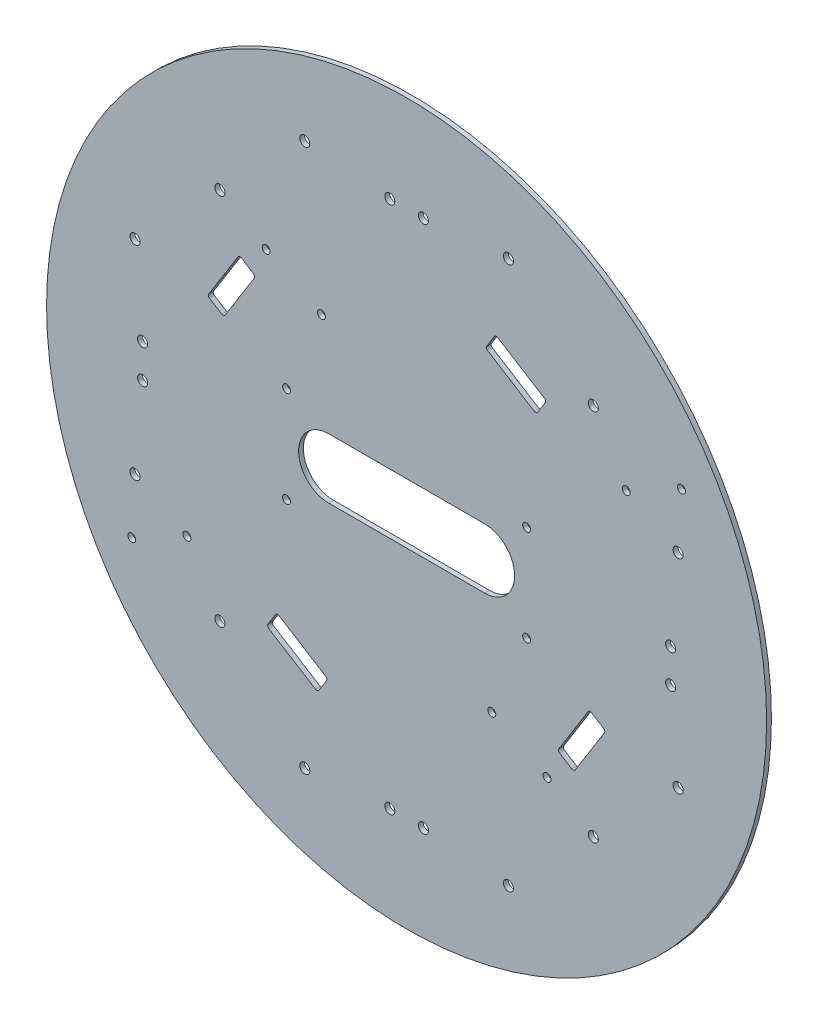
ISO-10303-21;
HEADER;
FILE_DESCRIPTION(('STEP AP214'),'2;1');
FILE_NAME('part.step','',(''),(''),'','','');
FILE_SCHEMA(('AUTOMOTIVE_DESIGN { 1 0 10303 214 1 1 1 1 }'));
ENDSEC;
DATA;
#1=APPLICATION_CONTEXT('core data for automotive mechanical design processes');
#2=APPLICATION_PROTOCOL_DEFINITION('international standard','automotive_design',2000,#1);
#3=PRODUCT_CONTEXT('',#1,'mechanical');
#4=PRODUCT('Part','Part','',(#3));
#5=PRODUCT_RELATED_PRODUCT_CATEGORY('part','',(#4));
#6=PRODUCT_DEFINITION_FORMATION('','',#4);
#7=PRODUCT_DEFINITION_CONTEXT('part definition',#1,'design');
#8=PRODUCT_DEFINITION('design','',#6,#7);
#9=PRODUCT_DEFINITION_SHAPE('','',#8);
#10=(LENGTH_UNIT() NAMED_UNIT(*) SI_UNIT(.MILLI.,.METRE.));
#11=(NAMED_UNIT(*) PLANE_ANGLE_UNIT() SI_UNIT($,.RADIAN.));
#12=(NAMED_UNIT(*) SI_UNIT($,.STERADIAN.) SOLID_ANGLE_UNIT());
#13=UNCERTAINTY_MEASURE_WITH_UNIT(LENGTH_MEASURE(1.E-05),#10,'distance_accuracy_value','');
#14=(GEOMETRIC_REPRESENTATION_CONTEXT(3) GLOBAL_UNCERTAINTY_ASSIGNED_CONTEXT((#13)) GLOBAL_UNIT_ASSIGNED_CONTEXT((#10,
#11,#12)) REPRESENTATION_CONTEXT('',''));
#15=CARTESIAN_POINT('',(0.,0.,0.));
#16=DIRECTION('',(0.,0.,1.));
#17=DIRECTION('',(1.,0.,0.));
#18=AXIS2_PLACEMENT_3D('',#15,#16,#17);
#19=CARTESIAN_POINT('',(57.157990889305,67.9371371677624,0.));
#20=DIRECTION('',(0.,1.,0.));
#21=DIRECTION('',(1.,0.,0.));
#22=AXIS2_PLACEMENT_3D('',#19,#20,#21);
#23=PLANE('',#22);
#24=DIRECTION('',(0.,0.,1.));
#25=VECTOR('',#24,1.);
#26=CARTESIAN_POINT('',(57.1915649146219,67.9371371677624,0.));
#27=LINE('',#26,#25);
#28=CARTESIAN_POINT('',(57.1915649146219,67.9371371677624,0.));
#29=VERTEX_POINT('',#28);
#30=CARTESIAN_POINT('',(57.1915649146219,67.9371371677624,2.));
#31=VERTEX_POINT('',#30);
#32=EDGE_CURVE('E784',#29,#31,#27,.T.);
#33=ORIENTED_EDGE('',*,*,#32,.F.);
#34=DIRECTION('',(-1.,0.,0.));
#35=VECTOR('',#34,1.);
#36=CARTESIAN_POINT('',(57.157990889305,67.9371371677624,0.));
#37=LINE('',#36,#35);
#38=CARTESIAN_POINT('',(57.157990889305,67.9371371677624,0.));
#39=VERTEX_POINT('',#38);
#40=EDGE_CURVE('E434',#29,#39,#37,.T.);
#41=ORIENTED_EDGE('',*,*,#40,.T.);
#42=DIRECTION('',(0.,0.,1.));
#43=VECTOR('',#42,1.);
#44=CARTESIAN_POINT('',(57.157990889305,67.9371371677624,0.));
#45=LINE('',#44,#43);
#46=CARTESIAN_POINT('',(57.157990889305,67.9371371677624,2.));
#47=VERTEX_POINT('',#46);
#48=EDGE_CURVE('E10',#39,#47,#45,.T.);
#49=ORIENTED_EDGE('',*,*,#48,.T.);
#50=DIRECTION('',(-1.,0.,0.));
#51=VECTOR('',#50,1.);
#52=CARTESIAN_POINT('',(57.157990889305,67.9371371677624,2.));
#53=LINE('',#52,#51);
#54=EDGE_CURVE('E536',#31,#47,#53,.T.);
#55=ORIENTED_EDGE('',*,*,#54,.F.);
#56=EDGE_LOOP('',(#33,#41,#49,#55));
#57=FACE_BOUND('',#56,.T.);
#58=ADVANCED_FACE('F16',(#57),#23,.T.);
#59=CARTESIAN_POINT('',(57.157990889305,66.8998170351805,0.));
#60=DIRECTION('',(-1.,0.,0.));
#61=DIRECTION('',(0.,0.,1.));
#62=AXIS2_PLACEMENT_3D('',#59,#60,#61);
#63=PLANE('',#62);
#64=DIRECTION('',(0.,0.,-1.));
#65=VECTOR('',#64,1.);
#66=CARTESIAN_POINT('',(57.157990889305,67.8834074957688,0.));
#67=LINE('',#66,#65);
#68=CARTESIAN_POINT('',(57.157990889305,67.8834074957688,2.));
#69=VERTEX_POINT('',#68);
#70=CARTESIAN_POINT('',(57.157990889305,67.8834074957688,0.));
#71=VERTEX_POINT('',#70);
#72=EDGE_CURVE('E523',#69,#71,#67,.T.);
#73=ORIENTED_EDGE('',*,*,#72,.F.);
#74=DIRECTION('',(0.,-1.,0.));
#75=VECTOR('',#74,1.);
#76=CARTESIAN_POINT('',(57.157990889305,66.8998170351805,2.));
#77=LINE('',#76,#75);
#78=EDGE_CURVE('E540',#47,#69,#77,.T.);
#79=ORIENTED_EDGE('',*,*,#78,.F.);
#80=ORIENTED_EDGE('',*,*,#48,.F.);
#81=DIRECTION('',(0.,-1.,0.));
#82=VECTOR('',#81,1.);
#83=CARTESIAN_POINT('',(57.157990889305,66.8998170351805,0.));
#84=LINE('',#83,#82);
#85=EDGE_CURVE('E697',#39,#71,#84,.T.);
#86=ORIENTED_EDGE('',*,*,#85,.T.);
#87=EDGE_LOOP('',(#73,#79,#80,#86));
#88=FACE_BOUND('',#87,.T.);
#89=ADVANCED_FACE('F18',(#88),#63,.T.);
#90=CARTESIAN_POINT('',(-32.5,-12.5,0.));
#91=DIRECTION('',(0.,-1.,0.));
#92=DIRECTION('',(0.,0.,-1.));
#93=AXIS2_PLACEMENT_3D('',#90,#91,#92);
#94=PLANE('',#93);
#95=DIRECTION('',(1.,0.,0.));
#96=VECTOR('',#95,1.);
#97=CARTESIAN_POINT('',(-32.5,-12.5,2.));
#98=LINE('',#97,#96);
#99=CARTESIAN_POINT('',(-32.5,-12.5,2.));
#100=VERTEX_POINT('',#99);
#101=CARTESIAN_POINT('',(32.5,-12.5,2.));
#102=VERTEX_POINT('',#101);
#103=EDGE_CURVE('E572',#100,#102,#98,.T.);
#104=ORIENTED_EDGE('',*,*,#103,.T.);
#105=DIRECTION('',(0.,0.,1.));
#106=VECTOR('',#105,1.);
#107=CARTESIAN_POINT('',(32.5,-12.5,0.));
#108=LINE('',#107,#106);
#109=CARTESIAN_POINT('',(32.5,-12.5,0.));
#110=VERTEX_POINT('',#109);
#111=EDGE_CURVE('E25',#110,#102,#108,.T.);
#112=ORIENTED_EDGE('',*,*,#111,.F.);
#113=DIRECTION('',(1.,0.,0.));
#114=VECTOR('',#113,1.);
#115=CARTESIAN_POINT('',(-32.5,-12.5,0.));
#116=LINE('',#115,#114);
#117=CARTESIAN_POINT('',(-32.5,-12.5,0.));
#118=VERTEX_POINT('',#117);
#119=EDGE_CURVE('E681',#118,#110,#116,.T.);
#120=ORIENTED_EDGE('',*,*,#119,.F.);
#121=DIRECTION('',(0.,0.,1.));
#122=VECTOR('',#121,1.);
#123=CARTESIAN_POINT('',(-32.5,-12.5,0.));
#124=LINE('',#123,#122);
#125=EDGE_CURVE('E839',#118,#100,#124,.T.);
#126=ORIENTED_EDGE('',*,*,#125,.T.);
#127=EDGE_LOOP('',(#104,#112,#120,#126));
#128=FACE_BOUND('',#127,.T.);
#129=ADVANCED_FACE('F856',(#128),#94,.F.);
#130=CARTESIAN_POINT('',(-32.5,12.5,0.));
#131=DIRECTION('',(0.,1.,0.));
#132=DIRECTION('',(1.,0.,0.));
#133=AXIS2_PLACEMENT_3D('',#130,#131,#132);
#134=PLANE('',#133);
#135=DIRECTION('',(-1.,0.,0.));
#136=VECTOR('',#135,1.);
#137=CARTESIAN_POINT('',(-32.5,12.5,2.));
#138=LINE('',#137,#136);
#139=CARTESIAN_POINT('',(32.5,12.5,2.));
#140=VERTEX_POINT('',#139);
#141=CARTESIAN_POINT('',(-32.5,12.5,2.));
#142=VERTEX_POINT('',#141);
#143=EDGE_CURVE('E568',#140,#142,#138,.T.);
#144=ORIENTED_EDGE('',*,*,#143,.T.);
#145=DIRECTION('',(0.,0.,1.));
#146=VECTOR('',#145,1.);
#147=CARTESIAN_POINT('',(-32.5,12.5,0.));
#148=LINE('',#147,#146);
#149=CARTESIAN_POINT('',(-32.5,12.5,0.));
#150=VERTEX_POINT('',#149);
#151=EDGE_CURVE('E842',#150,#142,#148,.T.);
#152=ORIENTED_EDGE('',*,*,#151,.F.);
#153=DIRECTION('',(-1.,0.,0.));
#154=VECTOR('',#153,1.);
#155=CARTESIAN_POINT('',(-32.5,12.5,0.));
#156=LINE('',#155,#154);
#157=CARTESIAN_POINT('',(32.5,12.5,0.));
#158=VERTEX_POINT('',#157);
#159=EDGE_CURVE('E700',#158,#150,#156,.T.);
#160=ORIENTED_EDGE('',*,*,#159,.F.);
#161=DIRECTION('',(0.,0.,1.));
#162=VECTOR('',#161,1.);
#163=CARTESIAN_POINT('',(32.5,12.5,0.));
#164=LINE('',#163,#162);
#165=EDGE_CURVE('E406',#158,#140,#164,.T.);
#166=ORIENTED_EDGE('',*,*,#165,.T.);
#167=EDGE_LOOP('',(#144,#152,#160,#166));
#168=FACE_BOUND('',#167,.T.);
#169=ADVANCED_FACE('F866',(#168),#134,.F.);
#170=CARTESIAN_POINT('',(-32.5,0.,0.));
#171=DIRECTION('',(0.,0.,1.));
#172=DIRECTION('',(1.,0.,0.));
#173=AXIS2_PLACEMENT_3D('',#170,#171,#172);
#174=CYLINDRICAL_SURFACE('',#173,12.5);
#175=CARTESIAN_POINT('',(-32.5,0.,2.));
#176=DIRECTION('',(0.,0.,1.));
#177=DIRECTION('',(1.,0.,0.));
#178=AXIS2_PLACEMENT_3D('',#175,#176,#177);
#179=CIRCLE('',#178,12.5);
#180=EDGE_CURVE('E564',#142,#100,#179,.T.);
#181=ORIENTED_EDGE('',*,*,#180,.T.);
#182=ORIENTED_EDGE('',*,*,#125,.F.);
#183=CARTESIAN_POINT('',(-32.5,0.,0.));
#184=DIRECTION('',(0.,0.,1.));
#185=DIRECTION('',(1.,0.,0.));
#186=AXIS2_PLACEMENT_3D('',#183,#184,#185);
#187=CIRCLE('',#186,12.5);
#188=EDGE_CURVE('E716',#150,#118,#187,.T.);
#189=ORIENTED_EDGE('',*,*,#188,.F.);
#190=ORIENTED_EDGE('',*,*,#151,.T.);
#191=EDGE_LOOP('',(#181,#182,#189,#190));
#192=FACE_BOUND('',#191,.T.);
#193=ADVANCED_FACE('F862',(#192),#174,.F.);
#194=CARTESIAN_POINT('',(81.5703520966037,-37.4102614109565,0.));
#195=DIRECTION('',(0.,0.,-1.));
#196=DIRECTION('',(-1.,0.,0.));
#197=AXIS2_PLACEMENT_3D('',#194,#195,#196);
#198=CYLINDRICAL_SURFACE('',#197,1.);
#199=CARTESIAN_POINT('',(81.5703520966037,-37.4102614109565,0.));
#200=DIRECTION('',(0.,0.,1.));
#201=DIRECTION('',(1.,0.,0.));
#202=AXIS2_PLACEMENT_3D('',#199,#200,#201);
#203=CIRCLE('',#202,1.);
#204=CARTESIAN_POINT('',(82.4184001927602,-37.9401806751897,0.));
#205=VERTEX_POINT('',#204);
#206=CARTESIAN_POINT('',(82.100271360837,-36.5622133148,0.));
#207=VERTEX_POINT('',#206);
#208=EDGE_CURVE('E730',#205,#207,#203,.T.);
#209=ORIENTED_EDGE('',*,*,#208,.F.);
#210=DIRECTION('',(0.,0.,-1.));
#211=VECTOR('',#210,1.);
#212=CARTESIAN_POINT('',(82.4184001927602,-37.9401806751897,0.));
#213=LINE('',#212,#211);
#214=CARTESIAN_POINT('',(82.4184001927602,-37.9401806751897,2.));
#215=VERTEX_POINT('',#214);
#216=EDGE_CURVE('E832',#215,#205,#213,.T.);
#217=ORIENTED_EDGE('',*,*,#216,.F.);
#218=CARTESIAN_POINT('',(81.5703520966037,-37.4102614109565,2.));
#219=DIRECTION('',(0.,0.,-1.));
#220=DIRECTION('',(1.,0.,0.));
#221=AXIS2_PLACEMENT_3D('',#218,#219,#220);
#222=CIRCLE('',#221,1.);
#223=CARTESIAN_POINT('',(82.100271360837,-36.5622133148,2.));
#224=VERTEX_POINT('',#223);
#225=EDGE_CURVE('E580',#224,#215,#222,.T.);
#226=ORIENTED_EDGE('',*,*,#225,.F.);
#227=DIRECTION('',(0.,0.,1.));
#228=VECTOR('',#227,1.);
#229=CARTESIAN_POINT('',(82.100271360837,-36.5622133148,2.));
#230=LINE('',#229,#228);
#231=EDGE_CURVE('E826',#207,#224,#230,.T.);
#232=ORIENTED_EDGE('',*,*,#231,.F.);
#233=EDGE_LOOP('',(#209,#217,#226,#232));
#234=FACE_BOUND('',#233,.T.);
#235=ADVANCED_FACE('F1134',(#234),#198,.F.);
#236=CARTESIAN_POINT('',(76.4820635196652,-34.2307458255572,0.));
#237=DIRECTION('',(0.,0.,-1.));
#238=DIRECTION('',(-1.,0.,0.));
#239=AXIS2_PLACEMENT_3D('',#236,#237,#238);
#240=CYLINDRICAL_SURFACE('',#239,1.);
#241=CARTESIAN_POINT('',(76.4820635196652,-34.2307458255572,0.));
#242=DIRECTION('',(0.,0.,1.));
#243=DIRECTION('',(1.,0.,0.));
#244=AXIS2_PLACEMENT_3D('',#241,#242,#243);
#245=CIRCLE('',#244,1.);
#246=CARTESIAN_POINT('',(77.0119827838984,-33.3826977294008,0.));
#247=VERTEX_POINT('',#246);
#248=CARTESIAN_POINT('',(75.6340154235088,-33.700826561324,0.));
#249=VERTEX_POINT('',#248);
#250=EDGE_CURVE('E738',#247,#249,#245,.T.);
#251=ORIENTED_EDGE('',*,*,#250,.F.);
#252=DIRECTION('',(0.,0.,-1.));
#253=VECTOR('',#252,1.);
#254=CARTESIAN_POINT('',(77.0119827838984,-33.3826977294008,0.));
#255=LINE('',#254,#253);
#256=CARTESIAN_POINT('',(77.0119827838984,-33.3826977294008,2.));
#257=VERTEX_POINT('',#256);
#258=EDGE_CURVE('E811',#257,#247,#255,.T.);
#259=ORIENTED_EDGE('',*,*,#258,.F.);
#260=CARTESIAN_POINT('',(76.4820635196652,-34.2307458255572,2.));
#261=DIRECTION('',(0.,0.,-1.));
#262=DIRECTION('',(1.,0.,0.));
#263=AXIS2_PLACEMENT_3D('',#260,#261,#262);
#264=CIRCLE('',#263,1.);
#265=CARTESIAN_POINT('',(75.6340154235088,-33.700826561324,2.));
#266=VERTEX_POINT('',#265);
#267=EDGE_CURVE('E599',#266,#257,#264,.T.);
#268=ORIENTED_EDGE('',*,*,#267,.F.);
#269=DIRECTION('',(0.,0.,1.));
#270=VECTOR('',#269,1.);
#271=CARTESIAN_POINT('',(75.6340154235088,-33.700826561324,2.));
#272=LINE('',#271,#270);
#273=EDGE_CURVE('E653',#249,#266,#272,.T.);
#274=ORIENTED_EDGE('',*,*,#273,.F.);
#275=EDGE_LOOP('',(#251,#259,#268,#274));
#276=FACE_BOUND('',#275,.T.);
#277=ADVANCED_FACE('F1137',(#276),#240,.F.);
#278=CARTESIAN_POINT('',(69.38220901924,-56.9153676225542,0.));
#279=DIRECTION('',(0.,0.,-1.));
#280=DIRECTION('',(-1.,0.,0.));
#281=AXIS2_PLACEMENT_3D('',#278,#279,#280);
#282=CYLINDRICAL_SURFACE('',#281,1.);
#283=CARTESIAN_POINT('',(69.38220901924,-56.9153676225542,0.));
#284=DIRECTION('',(0.,0.,1.));
#285=DIRECTION('',(1.,0.,0.));
#286=AXIS2_PLACEMENT_3D('',#283,#284,#285);
#287=CIRCLE('',#286,1.);
#288=CARTESIAN_POINT('',(68.8522897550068,-57.7634157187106,0.));
#289=VERTEX_POINT('',#288);
#290=CARTESIAN_POINT('',(70.2302571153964,-57.4452868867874,0.));
#291=VERTEX_POINT('',#290);
#292=EDGE_CURVE('E680',#289,#291,#287,.T.);
#293=ORIENTED_EDGE('',*,*,#292,.F.);
#294=DIRECTION('',(0.,0.,-1.));
#295=VECTOR('',#294,1.);
#296=CARTESIAN_POINT('',(68.8522897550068,-57.7634157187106,0.));
#297=LINE('',#296,#295);
#298=CARTESIAN_POINT('',(68.8522897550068,-57.7634157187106,2.));
#299=VERTEX_POINT('',#298);
#300=EDGE_CURVE('E654',#299,#289,#297,.T.);
#301=ORIENTED_EDGE('',*,*,#300,.F.);
#302=CARTESIAN_POINT('',(69.38220901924,-56.9153676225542,2.));
#303=DIRECTION('',(0.,0.,-1.));
#304=DIRECTION('',(1.,0.,0.));
#305=AXIS2_PLACEMENT_3D('',#302,#303,#304);
#306=CIRCLE('',#305,1.);
#307=CARTESIAN_POINT('',(70.2302571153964,-57.4452868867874,2.));
#308=VERTEX_POINT('',#307);
#309=EDGE_CURVE('E588',#308,#299,#306,.T.);
#310=ORIENTED_EDGE('',*,*,#309,.F.);
#311=DIRECTION('',(0.,0.,1.));
#312=VECTOR('',#311,1.);
#313=CARTESIAN_POINT('',(70.2302571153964,-57.4452868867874,2.));
#314=LINE('',#313,#312);
#315=EDGE_CURVE('E829',#291,#308,#314,.T.);
#316=ORIENTED_EDGE('',*,*,#315,.F.);
#317=EDGE_LOOP('',(#293,#301,#310,#316));
#318=FACE_BOUND('',#317,.T.);
#319=ADVANCED_FACE('F1139',(#318),#282,.F.);
#320=CARTESIAN_POINT('',(-37.4102614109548,-81.5703520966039,0.));
#321=DIRECTION('',(0.,0.,-1.));
#322=DIRECTION('',(-1.,0.,0.));
#323=AXIS2_PLACEMENT_3D('',#320,#321,#322);
#324=CYLINDRICAL_SURFACE('',#323,1.);
#325=CARTESIAN_POINT('',(-37.4102614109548,-81.5703520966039,0.));
#326=DIRECTION('',(0.,0.,1.));
#327=DIRECTION('',(1.,0.,0.));
#328=AXIS2_PLACEMENT_3D('',#325,#326,#327);
#329=CIRCLE('',#328,1.);
#330=CARTESIAN_POINT('',(-37.940180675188,-82.4184001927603,0.));
#331=VERTEX_POINT('',#330);
#332=CARTESIAN_POINT('',(-36.5622133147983,-82.1002713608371,0.));
#333=VERTEX_POINT('',#332);
#334=EDGE_CURVE('E749',#331,#333,#329,.T.);
#335=ORIENTED_EDGE('',*,*,#334,.F.);
#336=DIRECTION('',(0.,0.,-1.));
#337=VECTOR('',#336,1.);
#338=CARTESIAN_POINT('',(-37.940180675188,-82.4184001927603,0.));
#339=LINE('',#338,#337);
#340=CARTESIAN_POINT('',(-37.940180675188,-82.4184001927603,2.));
#341=VERTEX_POINT('',#340);
#342=EDGE_CURVE('E818',#341,#331,#339,.T.);
#343=ORIENTED_EDGE('',*,*,#342,.F.);
#344=CARTESIAN_POINT('',(-37.4102614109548,-81.5703520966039,2.));
#345=DIRECTION('',(0.,0.,-1.));
#346=DIRECTION('',(1.,0.,0.));
#347=AXIS2_PLACEMENT_3D('',#344,#345,#346);
#348=CIRCLE('',#347,1.);
#349=CARTESIAN_POINT('',(-36.5622133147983,-82.1002713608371,2.));
#350=VERTEX_POINT('',#349);
#351=EDGE_CURVE('E607',#350,#341,#348,.T.);
#352=ORIENTED_EDGE('',*,*,#351,.F.);
#353=DIRECTION('',(0.,0.,1.));
#354=VECTOR('',#353,1.);
#355=CARTESIAN_POINT('',(-36.5622133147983,-82.1002713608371,2.));
#356=LINE('',#355,#354);
#357=EDGE_CURVE('E815',#333,#350,#356,.T.);
#358=ORIENTED_EDGE('',*,*,#357,.F.);
#359=EDGE_LOOP('',(#335,#343,#352,#358));
#360=FACE_BOUND('',#359,.T.);
#361=ADVANCED_FACE('F1142',(#360),#324,.F.);
#362=CARTESIAN_POINT('',(-53.7358520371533,-64.2939204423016,0.));
#363=DIRECTION('',(0.,0.,-1.));
#364=DIRECTION('',(-1.,0.,0.));
#365=AXIS2_PLACEMENT_3D('',#362,#363,#364);
#366=CYLINDRICAL_SURFACE('',#365,1.);
#367=CARTESIAN_POINT('',(-53.7358520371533,-64.2939204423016,0.));
#368=DIRECTION('',(0.,0.,1.));
#369=DIRECTION('',(1.,0.,0.));
#370=AXIS2_PLACEMENT_3D('',#367,#368,#369);
#371=CIRCLE('',#370,1.);
#372=CARTESIAN_POINT('',(-53.2059327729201,-63.4458723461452,0.));
#373=VERTEX_POINT('',#372);
#374=CARTESIAN_POINT('',(-54.5839001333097,-63.7640011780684,0.));
#375=VERTEX_POINT('',#374);
#376=EDGE_CURVE('E365',#373,#375,#371,.T.);
#377=ORIENTED_EDGE('',*,*,#376,.F.);
#378=DIRECTION('',(0.,0.,-1.));
#379=VECTOR('',#378,1.);
#380=CARTESIAN_POINT('',(-53.2059327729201,-63.4458723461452,0.));
#381=LINE('',#380,#379);
#382=CARTESIAN_POINT('',(-53.2059327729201,-63.4458723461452,2.));
#383=VERTEX_POINT('',#382);
#384=EDGE_CURVE('E808',#383,#373,#381,.T.);
#385=ORIENTED_EDGE('',*,*,#384,.F.);
#386=CARTESIAN_POINT('',(-53.7358520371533,-64.2939204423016,2.));
#387=DIRECTION('',(0.,0.,-1.));
#388=DIRECTION('',(1.,0.,0.));
#389=AXIS2_PLACEMENT_3D('',#386,#387,#388);
#390=CIRCLE('',#389,1.);
#391=CARTESIAN_POINT('',(-54.5839001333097,-63.7640011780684,2.));
#392=VERTEX_POINT('',#391);
#393=EDGE_CURVE('E617',#392,#383,#390,.T.);
#394=ORIENTED_EDGE('',*,*,#393,.F.);
#395=DIRECTION('',(0.,0.,1.));
#396=VECTOR('',#395,1.);
#397=CARTESIAN_POINT('',(-54.5839001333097,-63.7640011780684,2.));
#398=LINE('',#397,#396);
#399=EDGE_CURVE('E821',#375,#392,#398,.T.);
#400=ORIENTED_EDGE('',*,*,#399,.F.);
#401=EDGE_LOOP('',(#377,#385,#394,#400));
#402=FACE_BOUND('',#401,.T.);
#403=ADVANCED_FACE('F1146',(#402),#366,.F.);
#404=CARTESIAN_POINT('',(-34.2307458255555,-76.4820635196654,0.));
#405=DIRECTION('',(0.,0.,-1.));
#406=DIRECTION('',(-1.,0.,0.));
#407=AXIS2_PLACEMENT_3D('',#404,#405,#406);
#408=CYLINDRICAL_SURFACE('',#407,1.);
#409=CARTESIAN_POINT('',(-34.2307458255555,-76.4820635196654,0.));
#410=DIRECTION('',(0.,0.,1.));
#411=DIRECTION('',(1.,0.,0.));
#412=AXIS2_PLACEMENT_3D('',#409,#410,#411);
#413=CIRCLE('',#412,1.);
#414=CARTESIAN_POINT('',(-33.3826977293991,-77.0119827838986,0.));
#415=VERTEX_POINT('',#414);
#416=CARTESIAN_POINT('',(-33.7008265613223,-75.634015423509,0.));
#417=VERTEX_POINT('',#416);
#418=EDGE_CURVE('E760',#415,#417,#413,.T.);
#419=ORIENTED_EDGE('',*,*,#418,.F.);
#420=DIRECTION('',(0.,0.,-1.));
#421=VECTOR('',#420,1.);
#422=CARTESIAN_POINT('',(-33.3826977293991,-77.0119827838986,0.));
#423=LINE('',#422,#421);
#424=CARTESIAN_POINT('',(-33.3826977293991,-77.0119827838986,2.));
#425=VERTEX_POINT('',#424);
#426=EDGE_CURVE('E807',#425,#415,#423,.T.);
#427=ORIENTED_EDGE('',*,*,#426,.F.);
#428=CARTESIAN_POINT('',(-34.2307458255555,-76.4820635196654,2.));
#429=DIRECTION('',(0.,0.,-1.));
#430=DIRECTION('',(1.,0.,0.));
#431=AXIS2_PLACEMENT_3D('',#428,#429,#430);
#432=CIRCLE('',#431,1.);
#433=CARTESIAN_POINT('',(-33.7008265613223,-75.634015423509,2.));
#434=VERTEX_POINT('',#433);
#435=EDGE_CURVE('E625',#434,#425,#432,.T.);
#436=ORIENTED_EDGE('',*,*,#435,.F.);
#437=DIRECTION('',(0.,0.,1.));
#438=VECTOR('',#437,1.);
#439=CARTESIAN_POINT('',(-33.7008265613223,-75.634015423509,2.));
#440=LINE('',#439,#438);
#441=EDGE_CURVE('E812',#417,#434,#440,.T.);
#442=ORIENTED_EDGE('',*,*,#441,.F.);
#443=EDGE_LOOP('',(#419,#427,#436,#442));
#444=FACE_BOUND('',#443,.T.);
#445=ADVANCED_FACE('F1152',(#444),#408,.F.);
#446=CARTESIAN_POINT('',(-76.4820635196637,34.2307458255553,0.));
#447=DIRECTION('',(0.,0.,-1.));
#448=DIRECTION('',(-1.,0.,0.));
#449=AXIS2_PLACEMENT_3D('',#446,#447,#448);
#450=CYLINDRICAL_SURFACE('',#449,1.);
#451=CARTESIAN_POINT('',(-76.4820635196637,34.2307458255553,0.));
#452=DIRECTION('',(0.,0.,1.));
#453=DIRECTION('',(1.,0.,0.));
#454=AXIS2_PLACEMENT_3D('',#451,#452,#453);
#455=CIRCLE('',#454,1.);
#456=CARTESIAN_POINT('',(-77.0119827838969,33.3826977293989,0.));
#457=VERTEX_POINT('',#456);
#458=CARTESIAN_POINT('',(-75.6340154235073,33.7008265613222,0.));
#459=VERTEX_POINT('',#458);
#460=EDGE_CURVE('E775',#457,#459,#455,.T.);
#461=ORIENTED_EDGE('',*,*,#460,.F.);
#462=DIRECTION('',(0.,0.,-1.));
#463=VECTOR('',#462,1.);
#464=CARTESIAN_POINT('',(-77.0119827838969,33.3826977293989,0.));
#465=LINE('',#464,#463);
#466=CARTESIAN_POINT('',(-77.0119827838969,33.3826977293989,2.));
#467=VERTEX_POINT('',#466);
#468=EDGE_CURVE('E795',#467,#457,#465,.T.);
#469=ORIENTED_EDGE('',*,*,#468,.F.);
#470=CARTESIAN_POINT('',(-76.4820635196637,34.2307458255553,2.));
#471=DIRECTION('',(0.,0.,-1.));
#472=DIRECTION('',(1.,0.,0.));
#473=AXIS2_PLACEMENT_3D('',#470,#471,#472);
#474=CIRCLE('',#473,1.);
#475=CARTESIAN_POINT('',(-75.6340154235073,33.7008265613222,2.));
#476=VERTEX_POINT('',#475);
#477=EDGE_CURVE('E439',#476,#467,#474,.T.);
#478=ORIENTED_EDGE('',*,*,#477,.F.);
#479=DIRECTION('',(0.,0.,1.));
#480=VECTOR('',#479,1.);
#481=CARTESIAN_POINT('',(-75.6340154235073,33.7008265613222,2.));
#482=LINE('',#481,#480);
#483=EDGE_CURVE('E49',#459,#476,#482,.T.);
#484=ORIENTED_EDGE('',*,*,#483,.F.);
#485=EDGE_LOOP('',(#461,#469,#478,#484));
#486=FACE_BOUND('',#485,.T.);
#487=ADVANCED_FACE('F1148',(#486),#450,.F.);
#488=CARTESIAN_POINT('',(-69.3822090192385,56.9153676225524,0.));
#489=DIRECTION('',(0.,0.,-1.));
#490=DIRECTION('',(-1.,0.,0.));
#491=AXIS2_PLACEMENT_3D('',#488,#489,#490);
#492=CYLINDRICAL_SURFACE('',#491,1.);
#493=CARTESIAN_POINT('',(-69.3822090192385,56.9153676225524,0.));
#494=DIRECTION('',(0.,0.,1.));
#495=DIRECTION('',(1.,0.,0.));
#496=AXIS2_PLACEMENT_3D('',#493,#494,#495);
#497=CIRCLE('',#496,1.);
#498=CARTESIAN_POINT('',(-68.8522897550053,57.7634157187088,0.));
#499=VERTEX_POINT('',#498);
#500=CARTESIAN_POINT('',(-70.230257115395,57.4452868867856,0.));
#501=VERTEX_POINT('',#500);
#502=EDGE_CURVE('E701',#499,#501,#497,.T.);
#503=ORIENTED_EDGE('',*,*,#502,.F.);
#504=DIRECTION('',(0.,0.,-1.));
#505=VECTOR('',#504,1.);
#506=CARTESIAN_POINT('',(-68.8522897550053,57.7634157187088,0.));
#507=LINE('',#506,#505);
#508=CARTESIAN_POINT('',(-68.8522897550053,57.7634157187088,2.));
#509=VERTEX_POINT('',#508);
#510=EDGE_CURVE('E804',#509,#499,#507,.T.);
#511=ORIENTED_EDGE('',*,*,#510,.F.);
#512=CARTESIAN_POINT('',(-69.3822090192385,56.9153676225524,2.));
#513=DIRECTION('',(0.,0.,-1.));
#514=DIRECTION('',(1.,0.,0.));
#515=AXIS2_PLACEMENT_3D('',#512,#513,#514);
#516=CIRCLE('',#515,1.);
#517=CARTESIAN_POINT('',(-70.230257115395,57.4452868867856,2.));
#518=VERTEX_POINT('',#517);
#519=EDGE_CURVE('E636',#518,#509,#516,.T.);
#520=ORIENTED_EDGE('',*,*,#519,.F.);
#521=DIRECTION('',(0.,0.,1.));
#522=VECTOR('',#521,1.);
#523=CARTESIAN_POINT('',(-70.230257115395,57.4452868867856,2.));
#524=LINE('',#523,#522);
#525=EDGE_CURVE('E798',#501,#518,#524,.T.);
#526=ORIENTED_EDGE('',*,*,#525,.F.);
#527=EDGE_LOOP('',(#503,#511,#520,#526));
#528=FACE_BOUND('',#527,.T.);
#529=ADVANCED_FACE('F1151',(#528),#492,.F.);
#530=CARTESIAN_POINT('',(-64.2939204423,53.7358520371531,0.));
#531=DIRECTION('',(0.,0.,-1.));
#532=DIRECTION('',(-1.,0.,0.));
#533=AXIS2_PLACEMENT_3D('',#530,#531,#532);
#534=CYLINDRICAL_SURFACE('',#533,1.);
#535=CARTESIAN_POINT('',(-64.2939204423,53.7358520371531,0.));
#536=DIRECTION('',(0.,0.,1.));
#537=DIRECTION('',(1.,0.,0.));
#538=AXIS2_PLACEMENT_3D('',#535,#536,#537);
#539=CIRCLE('',#538,1.);
#540=CARTESIAN_POINT('',(-63.4458723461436,53.2059327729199,0.));
#541=VERTEX_POINT('',#540);
#542=CARTESIAN_POINT('',(-63.7640011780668,54.5839001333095,0.));
#543=VERTEX_POINT('',#542);
#544=EDGE_CURVE('E670',#541,#543,#539,.T.);
#545=ORIENTED_EDGE('',*,*,#544,.F.);
#546=DIRECTION('',(0.,0.,-1.));
#547=VECTOR('',#546,1.);
#548=CARTESIAN_POINT('',(-63.4458723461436,53.2059327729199,0.));
#549=LINE('',#548,#547);
#550=CARTESIAN_POINT('',(-63.4458723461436,53.2059327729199,2.));
#551=VERTEX_POINT('',#550);
#552=EDGE_CURVE('E38',#551,#541,#549,.T.);
#553=ORIENTED_EDGE('',*,*,#552,.F.);
#554=CARTESIAN_POINT('',(-64.2939204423,53.7358520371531,2.));
#555=DIRECTION('',(0.,0.,-1.));
#556=DIRECTION('',(1.,0.,0.));
#557=AXIS2_PLACEMENT_3D('',#554,#555,#556);
#558=CIRCLE('',#557,1.);
#559=CARTESIAN_POINT('',(-63.7640011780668,54.5839001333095,2.));
#560=VERTEX_POINT('',#559);
#561=EDGE_CURVE('E644',#560,#551,#558,.T.);
#562=ORIENTED_EDGE('',*,*,#561,.F.);
#563=DIRECTION('',(0.,0.,1.));
#564=VECTOR('',#563,1.);
#565=CARTESIAN_POINT('',(-63.7640011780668,54.5839001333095,2.));
#566=LINE('',#565,#564);
#567=EDGE_CURVE('E801',#543,#560,#566,.T.);
#568=ORIENTED_EDGE('',*,*,#567,.F.);
#569=EDGE_LOOP('',(#545,#553,#562,#568));
#570=FACE_BOUND('',#569,.T.);
#571=ADVANCED_FACE('F1155',(#570),#534,.F.);
#572=CARTESIAN_POINT('',(53.7358520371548,64.2939204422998,0.));
#573=DIRECTION('',(0.,0.,-1.));
#574=DIRECTION('',(-1.,0.,0.));
#575=AXIS2_PLACEMENT_3D('',#572,#573,#574);
#576=CYLINDRICAL_SURFACE('',#575,1.);
#577=CARTESIAN_POINT('',(53.7358520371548,64.2939204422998,0.));
#578=DIRECTION('',(0.,0.,1.));
#579=DIRECTION('',(1.,0.,0.));
#580=AXIS2_PLACEMENT_3D('',#577,#578,#579);
#581=CIRCLE('',#580,1.);
#582=CARTESIAN_POINT('',(53.2059327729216,63.4458723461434,0.));
#583=VERTEX_POINT('',#582);
#584=CARTESIAN_POINT('',(54.5839001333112,63.7640011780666,0.));
#585=VERTEX_POINT('',#584);
#586=EDGE_CURVE('E694',#583,#585,#581,.T.);
#587=ORIENTED_EDGE('',*,*,#586,.F.);
#588=DIRECTION('',(0.,0.,-1.));
#589=VECTOR('',#588,1.);
#590=CARTESIAN_POINT('',(53.2059327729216,63.4458723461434,0.));
#591=LINE('',#590,#589);
#592=CARTESIAN_POINT('',(53.2059327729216,63.4458723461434,2.));
#593=VERTEX_POINT('',#592);
#594=EDGE_CURVE('E711',#593,#583,#591,.T.);
#595=ORIENTED_EDGE('',*,*,#594,.F.);
#596=CARTESIAN_POINT('',(53.7358520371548,64.2939204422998,2.));
#597=DIRECTION('',(0.,0.,-1.));
#598=DIRECTION('',(1.,0.,0.));
#599=AXIS2_PLACEMENT_3D('',#596,#597,#598);
#600=CIRCLE('',#599,1.);
#601=CARTESIAN_POINT('',(54.5839001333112,63.7640011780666,2.));
#602=VERTEX_POINT('',#601);
#603=EDGE_CURVE('E541',#602,#593,#600,.T.);
#604=ORIENTED_EDGE('',*,*,#603,.F.);
#605=DIRECTION('',(0.,0.,1.));
#606=VECTOR('',#605,1.);
#607=CARTESIAN_POINT('',(54.5839001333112,63.7640011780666,2.));
#608=LINE('',#607,#606);
#609=EDGE_CURVE('E531',#585,#602,#608,.T.);
#610=ORIENTED_EDGE('',*,*,#609,.F.);
#611=EDGE_LOOP('',(#587,#595,#604,#610));
#612=FACE_BOUND('',#611,.T.);
#613=ADVANCED_FACE('F1069',(#612),#576,.F.);
#614=CARTESIAN_POINT('',(37.4102614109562,81.5703520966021,0.));
#615=DIRECTION('',(0.,0.,-1.));
#616=DIRECTION('',(-1.,0.,0.));
#617=AXIS2_PLACEMENT_3D('',#614,#615,#616);
#618=CYLINDRICAL_SURFACE('',#617,1.);
#619=CARTESIAN_POINT('',(37.4102614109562,81.5703520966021,0.));
#620=DIRECTION('',(0.,0.,1.));
#621=DIRECTION('',(1.,0.,0.));
#622=AXIS2_PLACEMENT_3D('',#619,#620,#621);
#623=CIRCLE('',#622,1.);
#624=CARTESIAN_POINT('',(37.9401806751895,82.4184001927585,0.));
#625=VERTEX_POINT('',#624);
#626=CARTESIAN_POINT('',(36.5622133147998,82.1002713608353,0.));
#627=VERTEX_POINT('',#626);
#628=EDGE_CURVE('E660',#625,#627,#623,.T.);
#629=ORIENTED_EDGE('',*,*,#628,.F.);
#630=DIRECTION('',(0.,0.,-1.));
#631=VECTOR('',#630,1.);
#632=CARTESIAN_POINT('',(37.9401806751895,82.4184001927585,0.));
#633=LINE('',#632,#631);
#634=CARTESIAN_POINT('',(37.9401806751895,82.4184001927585,2.));
#635=VERTEX_POINT('',#634);
#636=EDGE_CURVE('E781',#635,#625,#633,.T.);
#637=ORIENTED_EDGE('',*,*,#636,.F.);
#638=CARTESIAN_POINT('',(37.4102614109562,81.5703520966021,2.));
#639=DIRECTION('',(0.,0.,-1.));
#640=DIRECTION('',(1.,0.,0.));
#641=AXIS2_PLACEMENT_3D('',#638,#639,#640);
#642=CIRCLE('',#641,1.);
#643=CARTESIAN_POINT('',(36.5622133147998,82.1002713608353,2.));
#644=VERTEX_POINT('',#643);
#645=EDGE_CURVE('E552',#644,#635,#642,.T.);
#646=ORIENTED_EDGE('',*,*,#645,.F.);
#647=DIRECTION('',(0.,0.,1.));
#648=VECTOR('',#647,1.);
#649=CARTESIAN_POINT('',(36.5622133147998,82.1002713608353,2.));
#650=LINE('',#649,#648);
#651=EDGE_CURVE('E674',#627,#644,#650,.T.);
#652=ORIENTED_EDGE('',*,*,#651,.F.);
#653=EDGE_LOOP('',(#629,#637,#646,#652));
#654=FACE_BOUND('',#653,.T.);
#655=ADVANCED_FACE('F1087',(#654),#618,.F.);
#656=CARTESIAN_POINT('',(56.915367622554,69.3822090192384,0.));
#657=DIRECTION('',(0.,0.,-1.));
#658=DIRECTION('',(-1.,0.,0.));
#659=AXIS2_PLACEMENT_3D('',#656,#657,#658);
#660=CYLINDRICAL_SURFACE('',#659,1.);
#661=CARTESIAN_POINT('',(56.915367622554,69.3822090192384,0.));
#662=DIRECTION('',(0.,0.,1.));
#663=DIRECTION('',(1.,0.,0.));
#664=AXIS2_PLACEMENT_3D('',#661,#662,#663);
#665=CIRCLE('',#664,1.);
#666=CARTESIAN_POINT('',(57.7634157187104,68.8522897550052,0.));
#667=VERTEX_POINT('',#666);
#668=CARTESIAN_POINT('',(57.4452868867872,70.2302571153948,0.));
#669=VERTEX_POINT('',#668);
#670=EDGE_CURVE('E669',#667,#669,#665,.T.);
#671=ORIENTED_EDGE('',*,*,#670,.F.);
#672=DIRECTION('',(0.,0.,-1.));
#673=VECTOR('',#672,1.);
#674=CARTESIAN_POINT('',(57.7634157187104,68.8522897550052,0.));
#675=LINE('',#674,#673);
#676=CARTESIAN_POINT('',(57.7634157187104,68.8522897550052,2.));
#677=VERTEX_POINT('',#676);
#678=EDGE_CURVE('E712',#677,#667,#675,.T.);
#679=ORIENTED_EDGE('',*,*,#678,.F.);
#680=CARTESIAN_POINT('',(56.915367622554,69.3822090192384,2.));
#681=DIRECTION('',(0.,0.,-1.));
#682=DIRECTION('',(1.,0.,0.));
#683=AXIS2_PLACEMENT_3D('',#680,#681,#682);
#684=CIRCLE('',#683,1.);
#685=CARTESIAN_POINT('',(57.4452868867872,70.2302571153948,2.));
#686=VERTEX_POINT('',#685);
#687=EDGE_CURVE('E560',#686,#677,#684,.T.);
#688=ORIENTED_EDGE('',*,*,#687,.F.);
#689=DIRECTION('',(0.,0.,1.));
#690=VECTOR('',#689,1.);
#691=CARTESIAN_POINT('',(57.4452868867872,70.2302571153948,2.));
#692=LINE('',#691,#690);
#693=EDGE_CURVE('E756',#669,#686,#692,.T.);
#694=ORIENTED_EDGE('',*,*,#693,.F.);
#695=EDGE_LOOP('',(#671,#679,#688,#694));
#696=FACE_BOUND('',#695,.T.);
#697=ADVANCED_FACE('F1094',(#696),#660,.F.);
#698=CARTESIAN_POINT('',(76.163934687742,-32.8527784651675,0.));
#699=DIRECTION('',(-0.848048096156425,0.529919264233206,0.));
#700=DIRECTION('',(0.,0.,1.));
#701=AXIS2_PLACEMENT_3D('',#698,#699,#700);
#702=PLANE('',#701);
#703=DIRECTION('',(-0.529919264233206,-0.848048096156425,0.));
#704=VECTOR('',#703,1.);
#705=CARTESIAN_POINT('',(76.163934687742,-32.8527784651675,2.));
#706=LINE('',#705,#704);
#707=CARTESIAN_POINT('',(63.445872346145,-53.2059327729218,2.));
#708=VERTEX_POINT('',#707);
#709=EDGE_CURVE('E596',#266,#708,#706,.T.);
#710=ORIENTED_EDGE('',*,*,#709,.T.);
#711=DIRECTION('',(0.,0.,-1.));
#712=VECTOR('',#711,1.);
#713=CARTESIAN_POINT('',(63.445872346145,-53.2059327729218,0.));
#714=LINE('',#713,#712);
#715=CARTESIAN_POINT('',(63.445872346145,-53.2059327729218,0.));
#716=VERTEX_POINT('',#715);
#717=EDGE_CURVE('E392',#708,#716,#714,.T.);
#718=ORIENTED_EDGE('',*,*,#717,.T.);
#719=DIRECTION('',(-0.529919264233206,-0.848048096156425,0.));
#720=VECTOR('',#719,1.);
#721=CARTESIAN_POINT('',(76.163934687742,-32.8527784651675,0.));
#722=LINE('',#721,#720);
#723=EDGE_CURVE('E369',#249,#716,#722,.T.);
#724=ORIENTED_EDGE('',*,*,#723,.F.);
#725=ORIENTED_EDGE('',*,*,#273,.T.);
#726=EDGE_LOOP('',(#710,#718,#724,#725));
#727=FACE_BOUND('',#726,.T.);
#728=ADVANCED_FACE('F1161',(#727),#702,.F.);
#729=CARTESIAN_POINT('',(69.7003378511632,-58.2933349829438,0.));
#730=DIRECTION('',(-0.529919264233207,-0.848048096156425,0.));
#731=DIRECTION('',(-0.848048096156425,0.529919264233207,0.));
#732=AXIS2_PLACEMENT_3D('',#729,#730,#731);
#733=PLANE('',#732);
#734=DIRECTION('',(0.848048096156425,-0.529919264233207,0.));
#735=VECTOR('',#734,1.);
#736=CARTESIAN_POINT('',(69.7003378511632,-58.2933349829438,2.));
#737=LINE('',#736,#735);
#738=CARTESIAN_POINT('',(63.7640011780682,-54.5839001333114,2.));
#739=VERTEX_POINT('',#738);
#740=EDGE_CURVE('E592',#739,#299,#737,.T.);
#741=ORIENTED_EDGE('',*,*,#740,.T.);
#742=ORIENTED_EDGE('',*,*,#300,.T.);
#743=DIRECTION('',(0.848048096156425,-0.529919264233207,0.));
#744=VECTOR('',#743,1.);
#745=CARTESIAN_POINT('',(69.7003378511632,-58.2933349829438,0.));
#746=LINE('',#745,#744);
#747=CARTESIAN_POINT('',(63.7640011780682,-54.5839001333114,0.));
#748=VERTEX_POINT('',#747);
#749=EDGE_CURVE('E676',#748,#289,#746,.T.);
#750=ORIENTED_EDGE('',*,*,#749,.F.);
#751=DIRECTION('',(0.,0.,1.));
#752=VECTOR('',#751,1.);
#753=CARTESIAN_POINT('',(63.7640011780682,-54.5839001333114,2.));
#754=LINE('',#753,#752);
#755=EDGE_CURVE('E649',#748,#739,#754,.T.);
#756=ORIENTED_EDGE('',*,*,#755,.T.);
#757=EDGE_LOOP('',(#741,#742,#750,#756));
#758=FACE_BOUND('',#757,.T.);
#759=ADVANCED_FACE('F1162',(#758),#733,.F.);
#760=CARTESIAN_POINT('',(82.9483194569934,-37.0921325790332,0.));
#761=DIRECTION('',(0.848048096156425,-0.529919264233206,0.));
#762=DIRECTION('',(0.,0.,-1.));
#763=AXIS2_PLACEMENT_3D('',#760,#761,#762);
#764=PLANE('',#763);
#765=DIRECTION('',(0.529919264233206,0.848048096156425,0.));
#766=VECTOR('',#765,1.);
#767=CARTESIAN_POINT('',(82.9483194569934,-37.0921325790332,0.));
#768=LINE('',#767,#766);
#769=EDGE_CURVE('E726',#291,#205,#768,.T.);
#770=ORIENTED_EDGE('',*,*,#769,.F.);
#771=ORIENTED_EDGE('',*,*,#315,.T.);
#772=DIRECTION('',(0.529919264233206,0.848048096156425,0.));
#773=VECTOR('',#772,1.);
#774=CARTESIAN_POINT('',(82.9483194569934,-37.0921325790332,2.));
#775=LINE('',#774,#773);
#776=EDGE_CURVE('E584',#308,#215,#775,.T.);
#777=ORIENTED_EDGE('',*,*,#776,.T.);
#778=ORIENTED_EDGE('',*,*,#216,.T.);
#779=EDGE_LOOP('',(#770,#771,#777,#778));
#780=FACE_BOUND('',#779,.T.);
#781=ADVANCED_FACE('F1165',(#780),#764,.F.);
#782=CARTESIAN_POINT('',(82.9483194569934,-37.0921325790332,0.));
#783=DIRECTION('',(0.529919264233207,0.848048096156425,0.));
#784=DIRECTION('',(0.,0.,-1.));
#785=AXIS2_PLACEMENT_3D('',#782,#783,#784);
#786=PLANE('',#785);
#787=DIRECTION('',(-0.848048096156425,0.529919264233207,0.));
#788=VECTOR('',#787,1.);
#789=CARTESIAN_POINT('',(82.9483194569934,-37.0921325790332,2.));
#790=LINE('',#789,#788);
#791=EDGE_CURVE('E576',#224,#257,#790,.T.);
#792=ORIENTED_EDGE('',*,*,#791,.T.);
#793=ORIENTED_EDGE('',*,*,#258,.T.);
#794=DIRECTION('',(-0.848048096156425,0.529919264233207,0.));
#795=VECTOR('',#794,1.);
#796=CARTESIAN_POINT('',(82.9483194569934,-37.0921325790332,0.));
#797=LINE('',#796,#795);
#798=EDGE_CURVE('E734',#207,#247,#797,.T.);
#799=ORIENTED_EDGE('',*,*,#798,.F.);
#800=ORIENTED_EDGE('',*,*,#231,.T.);
#801=EDGE_LOOP('',(#792,#793,#799,#800));
#802=FACE_BOUND('',#801,.T.);
#803=ADVANCED_FACE('F1169',(#802),#786,.F.);
#804=CARTESIAN_POINT('',(-32.8527784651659,-76.1639346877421,0.));
#805=DIRECTION('',(0.529919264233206,0.848048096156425,0.));
#806=DIRECTION('',(0.,0.,-1.));
#807=AXIS2_PLACEMENT_3D('',#804,#805,#806);
#808=PLANE('',#807);
#809=DIRECTION('',(-0.848048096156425,0.529919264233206,0.));
#810=VECTOR('',#809,1.);
#811=CARTESIAN_POINT('',(-32.8527784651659,-76.1639346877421,0.));
#812=LINE('',#811,#810);
#813=EDGE_CURVE('E741',#417,#373,#812,.T.);
#814=ORIENTED_EDGE('',*,*,#813,.F.);
#815=ORIENTED_EDGE('',*,*,#441,.T.);
#816=DIRECTION('',(-0.848048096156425,0.529919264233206,0.));
#817=VECTOR('',#816,1.);
#818=CARTESIAN_POINT('',(-32.8527784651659,-76.1639346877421,2.));
#819=LINE('',#818,#817);
#820=EDGE_CURVE('E621',#434,#383,#819,.T.);
#821=ORIENTED_EDGE('',*,*,#820,.T.);
#822=ORIENTED_EDGE('',*,*,#384,.T.);
#823=EDGE_LOOP('',(#814,#815,#821,#822));
#824=FACE_BOUND('',#823,.T.);
#825=ADVANCED_FACE('F1171',(#824),#808,.F.);
#826=CARTESIAN_POINT('',(-58.2933349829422,-69.7003378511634,0.));
#827=DIRECTION('',(-0.848048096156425,0.529919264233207,0.));
#828=DIRECTION('',(0.,0.,1.));
#829=AXIS2_PLACEMENT_3D('',#826,#827,#828);
#830=PLANE('',#829);
#831=DIRECTION('',(-0.529919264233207,-0.848048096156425,0.));
#832=VECTOR('',#831,1.);
#833=CARTESIAN_POINT('',(-58.2933349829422,-69.7003378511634,2.));
#834=LINE('',#833,#832);
#835=CARTESIAN_POINT('',(-57.763415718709,-68.852289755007,2.));
#836=VERTEX_POINT('',#835);
#837=EDGE_CURVE('E375',#392,#836,#834,.T.);
#838=ORIENTED_EDGE('',*,*,#837,.T.);
#839=DIRECTION('',(0.,0.,-1.));
#840=VECTOR('',#839,1.);
#841=CARTESIAN_POINT('',(-57.763415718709,-68.852289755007,0.));
#842=LINE('',#841,#840);
#843=CARTESIAN_POINT('',(-57.763415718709,-68.852289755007,0.));
#844=VERTEX_POINT('',#843);
#845=EDGE_CURVE('E372',#836,#844,#842,.T.);
#846=ORIENTED_EDGE('',*,*,#845,.T.);
#847=DIRECTION('',(-0.529919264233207,-0.848048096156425,0.));
#848=VECTOR('',#847,1.);
#849=CARTESIAN_POINT('',(-58.2933349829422,-69.7003378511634,0.));
#850=LINE('',#849,#848);
#851=EDGE_CURVE('E355',#375,#844,#850,.T.);
#852=ORIENTED_EDGE('',*,*,#851,.F.);
#853=ORIENTED_EDGE('',*,*,#399,.T.);
#854=EDGE_LOOP('',(#838,#846,#852,#853));
#855=FACE_BOUND('',#854,.T.);
#856=ADVANCED_FACE('F373',(#855),#830,.F.);
#857=CARTESIAN_POINT('',(-37.0921325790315,-82.9483194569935,0.));
#858=DIRECTION('',(-0.529919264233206,-0.848048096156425,0.));
#859=DIRECTION('',(-0.848048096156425,0.529919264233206,0.));
#860=AXIS2_PLACEMENT_3D('',#857,#858,#859);
#861=PLANE('',#860);
#862=DIRECTION('',(0.848048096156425,-0.529919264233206,0.));
#863=VECTOR('',#862,1.);
#864=CARTESIAN_POINT('',(-37.0921325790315,-82.9483194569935,0.));
#865=LINE('',#864,#863);
#866=CARTESIAN_POINT('',(-57.4452868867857,-70.2302571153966,0.));
#867=VERTEX_POINT('',#866);
#868=EDGE_CURVE('E368',#867,#331,#865,.T.);
#869=ORIENTED_EDGE('',*,*,#868,.F.);
#870=DIRECTION('',(0.,0.,1.));
#871=VECTOR('',#870,1.);
#872=CARTESIAN_POINT('',(-57.4452868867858,-70.2302571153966,2.));
#873=LINE('',#872,#871);
#874=CARTESIAN_POINT('',(-57.4452868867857,-70.2302571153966,2.));
#875=VERTEX_POINT('',#874);
#876=EDGE_CURVE('E383',#867,#875,#873,.T.);
#877=ORIENTED_EDGE('',*,*,#876,.T.);
#878=DIRECTION('',(0.848048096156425,-0.529919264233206,0.));
#879=VECTOR('',#878,1.);
#880=CARTESIAN_POINT('',(-37.0921325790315,-82.9483194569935,2.));
#881=LINE('',#880,#879);
#882=EDGE_CURVE('E611',#875,#341,#881,.T.);
#883=ORIENTED_EDGE('',*,*,#882,.T.);
#884=ORIENTED_EDGE('',*,*,#342,.T.);
#885=EDGE_LOOP('',(#869,#877,#883,#884));
#886=FACE_BOUND('',#885,.T.);
#887=ADVANCED_FACE('F1178',(#886),#861,.F.);
#888=CARTESIAN_POINT('',(-37.0921325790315,-82.9483194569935,0.));
#889=DIRECTION('',(0.848048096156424,-0.529919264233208,0.));
#890=DIRECTION('',(0.,0.,-1.));
#891=AXIS2_PLACEMENT_3D('',#888,#889,#890);
#892=PLANE('',#891);
#893=DIRECTION('',(0.529919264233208,0.848048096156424,0.));
#894=VECTOR('',#893,1.);
#895=CARTESIAN_POINT('',(-37.0921325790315,-82.9483194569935,2.));
#896=LINE('',#895,#894);
#897=EDGE_CURVE('E603',#350,#425,#896,.T.);
#898=ORIENTED_EDGE('',*,*,#897,.T.);
#899=ORIENTED_EDGE('',*,*,#426,.T.);
#900=DIRECTION('',(0.529919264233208,0.848048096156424,0.));
#901=VECTOR('',#900,1.);
#902=CARTESIAN_POINT('',(-37.0921325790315,-82.9483194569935,0.));
#903=LINE('',#902,#901);
#904=EDGE_CURVE('E753',#333,#415,#903,.T.);
#905=ORIENTED_EDGE('',*,*,#904,.F.);
#906=ORIENTED_EDGE('',*,*,#357,.T.);
#907=EDGE_LOOP('',(#898,#899,#905,#906));
#908=FACE_BOUND('',#907,.T.);
#909=ADVANCED_FACE('F1181',(#908),#892,.F.);
#910=CARTESIAN_POINT('',(-76.1639346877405,32.8527784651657,0.));
#911=DIRECTION('',(0.848048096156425,-0.529919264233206,0.));
#912=DIRECTION('',(0.,0.,-1.));
#913=AXIS2_PLACEMENT_3D('',#910,#911,#912);
#914=PLANE('',#913);
#915=DIRECTION('',(0.529919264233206,0.848048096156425,0.));
#916=VECTOR('',#915,1.);
#917=CARTESIAN_POINT('',(-76.1639346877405,32.8527784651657,2.));
#918=LINE('',#917,#916);
#919=EDGE_CURVE('E648',#476,#551,#918,.T.);
#920=ORIENTED_EDGE('',*,*,#919,.T.);
#921=ORIENTED_EDGE('',*,*,#552,.T.);
#922=DIRECTION('',(0.529919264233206,0.848048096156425,0.));
#923=VECTOR('',#922,1.);
#924=CARTESIAN_POINT('',(-76.1639346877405,32.8527784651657,0.));
#925=LINE('',#924,#923);
#926=EDGE_CURVE('E675',#459,#541,#925,.T.);
#927=ORIENTED_EDGE('',*,*,#926,.F.);
#928=ORIENTED_EDGE('',*,*,#483,.T.);
#929=EDGE_LOOP('',(#920,#921,#927,#928));
#930=FACE_BOUND('',#929,.T.);
#931=ADVANCED_FACE('F1188',(#930),#914,.F.);
#932=CARTESIAN_POINT('',(-69.7003378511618,58.293334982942,0.));
#933=DIRECTION('',(0.529919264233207,0.848048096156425,0.));
#934=DIRECTION('',(0.,0.,-1.));
#935=AXIS2_PLACEMENT_3D('',#932,#933,#934);
#936=PLANE('',#935);
#937=DIRECTION('',(-0.848048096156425,0.529919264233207,0.));
#938=VECTOR('',#937,1.);
#939=CARTESIAN_POINT('',(-69.7003378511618,58.293334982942,0.));
#940=LINE('',#939,#938);
#941=EDGE_CURVE('E706',#543,#499,#940,.T.);
#942=ORIENTED_EDGE('',*,*,#941,.F.);
#943=ORIENTED_EDGE('',*,*,#567,.T.);
#944=DIRECTION('',(-0.848048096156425,0.529919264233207,0.));
#945=VECTOR('',#944,1.);
#946=CARTESIAN_POINT('',(-69.7003378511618,58.293334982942,2.));
#947=LINE('',#946,#945);
#948=EDGE_CURVE('E640',#560,#509,#947,.T.);
#949=ORIENTED_EDGE('',*,*,#948,.T.);
#950=ORIENTED_EDGE('',*,*,#510,.T.);
#951=EDGE_LOOP('',(#942,#943,#949,#950));
#952=FACE_BOUND('',#951,.T.);
#953=ADVANCED_FACE('F1192',(#952),#936,.F.);
#954=CARTESIAN_POINT('',(-82.9483194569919,37.0921325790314,0.));
#955=DIRECTION('',(-0.848048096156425,0.529919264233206,0.));
#956=DIRECTION('',(0.,0.,1.));
#957=AXIS2_PLACEMENT_3D('',#954,#955,#956);
#958=PLANE('',#957);
#959=DIRECTION('',(-0.529919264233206,-0.848048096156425,0.));
#960=VECTOR('',#959,1.);
#961=CARTESIAN_POINT('',(-82.9483194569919,37.0921325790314,0.));
#962=LINE('',#961,#960);
#963=CARTESIAN_POINT('',(-82.4184001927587,37.9401806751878,0.));
#964=VERTEX_POINT('',#963);
#965=EDGE_CURVE('E705',#501,#964,#962,.T.);
#966=ORIENTED_EDGE('',*,*,#965,.F.);
#967=ORIENTED_EDGE('',*,*,#525,.T.);
#968=DIRECTION('',(-0.529919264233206,-0.848048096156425,0.));
#969=VECTOR('',#968,1.);
#970=CARTESIAN_POINT('',(-82.9483194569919,37.0921325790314,2.));
#971=LINE('',#970,#969);
#972=CARTESIAN_POINT('',(-82.4184001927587,37.9401806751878,2.));
#973=VERTEX_POINT('',#972);
#974=EDGE_CURVE('E633',#518,#973,#971,.T.);
#975=ORIENTED_EDGE('',*,*,#974,.T.);
#976=DIRECTION('',(0.,0.,-1.));
#977=VECTOR('',#976,1.);
#978=CARTESIAN_POINT('',(-82.4184001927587,37.9401806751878,0.));
#979=LINE('',#978,#977);
#980=EDGE_CURVE('E459',#973,#964,#979,.T.);
#981=ORIENTED_EDGE('',*,*,#980,.T.);
#982=EDGE_LOOP('',(#966,#967,#975,#981));
#983=FACE_BOUND('',#982,.T.);
#984=ADVANCED_FACE('F1195',(#983),#958,.F.);
#985=CARTESIAN_POINT('',(-82.9483194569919,37.0921325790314,0.));
#986=DIRECTION('',(-0.529919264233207,-0.848048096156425,0.));
#987=DIRECTION('',(-0.848048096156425,0.529919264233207,0.));
#988=AXIS2_PLACEMENT_3D('',#985,#986,#987);
#989=PLANE('',#988);
#990=DIRECTION('',(0.848048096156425,-0.529919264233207,0.));
#991=VECTOR('',#990,1.);
#992=CARTESIAN_POINT('',(-82.9483194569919,37.0921325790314,0.));
#993=LINE('',#992,#991);
#994=CARTESIAN_POINT('',(-82.1002713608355,36.5622133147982,0.));
#995=VERTEX_POINT('',#994);
#996=EDGE_CURVE('E771',#995,#457,#993,.T.);
#997=ORIENTED_EDGE('',*,*,#996,.F.);
#998=DIRECTION('',(0.,0.,1.));
#999=VECTOR('',#998,1.);
#1000=CARTESIAN_POINT('',(-82.1002713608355,36.5622133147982,2.));
#1001=LINE('',#1000,#999);
#1002=CARTESIAN_POINT('',(-82.1002713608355,36.5622133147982,2.));
#1003=VERTEX_POINT('',#1002);
#1004=EDGE_CURVE('E791',#995,#1003,#1001,.T.);
#1005=ORIENTED_EDGE('',*,*,#1004,.T.);
#1006=DIRECTION('',(0.848048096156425,-0.529919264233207,0.));
#1007=VECTOR('',#1006,1.);
#1008=CARTESIAN_POINT('',(-82.9483194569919,37.0921325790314,2.));
#1009=LINE('',#1008,#1007);
#1010=EDGE_CURVE('E629',#1003,#467,#1009,.T.);
#1011=ORIENTED_EDGE('',*,*,#1010,.T.);
#1012=ORIENTED_EDGE('',*,*,#468,.T.);
#1013=EDGE_LOOP('',(#997,#1005,#1011,#1012));
#1014=FACE_BOUND('',#1013,.T.);
#1015=ADVANCED_FACE('F1197',(#1014),#989,.F.);
#1016=CARTESIAN_POINT('',(32.8527784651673,76.1639346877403,0.));
#1017=DIRECTION('',(-0.529919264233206,-0.848048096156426,0.));
#1018=DIRECTION('',(-0.848048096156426,0.529919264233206,0.));
#1019=AXIS2_PLACEMENT_3D('',#1016,#1017,#1018);
#1020=PLANE('',#1019);
#1021=DIRECTION('',(0.848048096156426,-0.529919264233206,0.));
#1022=VECTOR('',#1021,1.);
#1023=CARTESIAN_POINT('',(32.8527784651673,76.1639346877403,0.));
#1024=LINE('',#1023,#1022);
#1025=CARTESIAN_POINT('',(33.7008265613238,75.6340154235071,0.));
#1026=VERTEX_POINT('',#1025);
#1027=EDGE_CURVE('E690',#1026,#583,#1024,.T.);
#1028=ORIENTED_EDGE('',*,*,#1027,.F.);
#1029=DIRECTION('',(0.,0.,1.));
#1030=VECTOR('',#1029,1.);
#1031=CARTESIAN_POINT('',(33.7008265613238,75.6340154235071,2.));
#1032=LINE('',#1031,#1030);
#1033=CARTESIAN_POINT('',(33.7008265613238,75.6340154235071,2.));
#1034=VERTEX_POINT('',#1033);
#1035=EDGE_CURVE('E707',#1026,#1034,#1032,.T.);
#1036=ORIENTED_EDGE('',*,*,#1035,.T.);
#1037=DIRECTION('',(0.848048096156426,-0.529919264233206,0.));
#1038=VECTOR('',#1037,1.);
#1039=CARTESIAN_POINT('',(32.8527784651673,76.1639346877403,2.));
#1040=LINE('',#1039,#1038);
#1041=EDGE_CURVE('E545',#1034,#593,#1040,.T.);
#1042=ORIENTED_EDGE('',*,*,#1041,.T.);
#1043=ORIENTED_EDGE('',*,*,#594,.T.);
#1044=EDGE_LOOP('',(#1028,#1036,#1042,#1043));
#1045=FACE_BOUND('',#1044,.T.);
#1046=ADVANCED_FACE('F1074',(#1045),#1020,.F.);
#1047=CARTESIAN_POINT('',(58.2933349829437,69.7003378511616,0.));
#1048=DIRECTION('',(0.848048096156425,-0.529919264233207,0.));
#1049=DIRECTION('',(0.,0.,-1.));
#1050=AXIS2_PLACEMENT_3D('',#1047,#1048,#1049);
#1051=PLANE('',#1050);
#1052=DIRECTION('',(0.529919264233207,0.848048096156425,0.));
#1053=VECTOR('',#1052,1.);
#1054=CARTESIAN_POINT('',(58.2933349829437,69.7003378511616,0.));
#1055=LINE('',#1054,#1053);
#1056=EDGE_CURVE('E438',#29,#667,#1055,.T.);
#1057=ORIENTED_EDGE('',*,*,#1056,.F.);
#1058=ORIENTED_EDGE('',*,*,#32,.T.);
#1059=DIRECTION('',(0.529919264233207,0.848048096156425,0.));
#1060=VECTOR('',#1059,1.);
#1061=CARTESIAN_POINT('',(58.2933349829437,69.7003378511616,2.));
#1062=LINE('',#1061,#1060);
#1063=EDGE_CURVE('E535',#31,#677,#1062,.T.);
#1064=ORIENTED_EDGE('',*,*,#1063,.T.);
#1065=ORIENTED_EDGE('',*,*,#678,.T.);
#1066=EDGE_LOOP('',(#1057,#1058,#1064,#1065));
#1067=FACE_BOUND('',#1066,.T.);
#1068=ADVANCED_FACE('F1097',(#1067),#1051,.F.);
#1069=CARTESIAN_POINT('',(37.092132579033,82.9483194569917,0.));
#1070=DIRECTION('',(0.529919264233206,0.848048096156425,0.));
#1071=DIRECTION('',(0.,0.,-1.));
#1072=AXIS2_PLACEMENT_3D('',#1069,#1070,#1071);
#1073=PLANE('',#1072);
#1074=DIRECTION('',(-0.848048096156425,0.529919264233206,0.));
#1075=VECTOR('',#1074,1.);
#1076=CARTESIAN_POINT('',(37.092132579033,82.9483194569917,0.));
#1077=LINE('',#1076,#1075);
#1078=EDGE_CURVE('E665',#669,#625,#1077,.T.);
#1079=ORIENTED_EDGE('',*,*,#1078,.F.);
#1080=ORIENTED_EDGE('',*,*,#693,.T.);
#1081=DIRECTION('',(-0.848048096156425,0.529919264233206,0.));
#1082=VECTOR('',#1081,1.);
#1083=CARTESIAN_POINT('',(37.092132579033,82.9483194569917,2.));
#1084=LINE('',#1083,#1082);
#1085=EDGE_CURVE('E556',#686,#635,#1084,.T.);
#1086=ORIENTED_EDGE('',*,*,#1085,.T.);
#1087=ORIENTED_EDGE('',*,*,#636,.T.);
#1088=EDGE_LOOP('',(#1079,#1080,#1086,#1087));
#1089=FACE_BOUND('',#1088,.T.);
#1090=ADVANCED_FACE('F1090',(#1089),#1073,.F.);
#1091=CARTESIAN_POINT('',(37.092132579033,82.9483194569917,0.));
#1092=DIRECTION('',(-0.848048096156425,0.529919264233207,0.));
#1093=DIRECTION('',(0.,0.,1.));
#1094=AXIS2_PLACEMENT_3D('',#1091,#1092,#1093);
#1095=PLANE('',#1094);
#1096=DIRECTION('',(-0.529919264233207,-0.848048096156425,0.));
#1097=VECTOR('',#1096,1.);
#1098=CARTESIAN_POINT('',(37.092132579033,82.9483194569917,2.));
#1099=LINE('',#1098,#1097);
#1100=CARTESIAN_POINT('',(33.3826977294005,77.0119827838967,2.));
#1101=VERTEX_POINT('',#1100);
#1102=EDGE_CURVE('E549',#644,#1101,#1099,.T.);
#1103=ORIENTED_EDGE('',*,*,#1102,.T.);
#1104=DIRECTION('',(0.,0.,-1.));
#1105=VECTOR('',#1104,1.);
#1106=CARTESIAN_POINT('',(33.3826977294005,77.0119827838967,0.));
#1107=LINE('',#1106,#1105);
#1108=CARTESIAN_POINT('',(33.3826977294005,77.0119827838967,0.));
#1109=VERTEX_POINT('',#1108);
#1110=EDGE_CURVE('E446',#1101,#1109,#1107,.T.);
#1111=ORIENTED_EDGE('',*,*,#1110,.T.);
#1112=DIRECTION('',(-0.529919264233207,-0.848048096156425,0.));
#1113=VECTOR('',#1112,1.);
#1114=CARTESIAN_POINT('',(37.092132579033,82.9483194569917,0.));
#1115=LINE('',#1114,#1113);
#1116=EDGE_CURVE('E664',#627,#1109,#1115,.T.);
#1117=ORIENTED_EDGE('',*,*,#1116,.F.);
#1118=ORIENTED_EDGE('',*,*,#651,.T.);
#1119=EDGE_LOOP('',(#1103,#1111,#1117,#1118));
#1120=FACE_BOUND('',#1119,.T.);
#1121=ADVANCED_FACE('F1082',(#1120),#1095,.F.);
#1122=CARTESIAN_POINT('',(0.,0.,0.));
#1123=DIRECTION('',(0.,0.,1.));
#1124=DIRECTION('',(1.,0.,0.));
#1125=AXIS2_PLACEMENT_3D('',#1122,#1123,#1124);
#1126=PLANE('',#1125);
#1127=CARTESIAN_POINT('',(110.,7.,0.));
#1128=DIRECTION('',(0.,0.,1.));
#1129=DIRECTION('',(-1.,0.,0.));
#1130=AXIS2_PLACEMENT_3D('',#1127,#1128,#1129);
#1131=CIRCLE('',#1130,2.1);
#1132=CARTESIAN_POINT('',(107.9,7.,0.));
#1133=VERTEX_POINT('',#1132);
#1134=EDGE_CURVE('E469',#1133,#1133,#1131,.T.);
#1135=ORIENTED_EDGE('',*,*,#1134,.T.);
#1136=EDGE_LOOP('',(#1135));
#1137=FACE_BOUND('',#1136,.T.);
#1138=CARTESIAN_POINT('',(110.,-7.,0.));
#1139=DIRECTION('',(0.,0.,1.));
#1140=DIRECTION('',(1.,0.,0.));
#1141=AXIS2_PLACEMENT_3D('',#1138,#1139,#1140);
#1142=CIRCLE('',#1141,2.1);
#1143=CARTESIAN_POINT('',(112.1,-7.,0.));
#1144=VERTEX_POINT('',#1143);
#1145=EDGE_CURVE('E474',#1144,#1144,#1142,.T.);
#1146=ORIENTED_EDGE('',*,*,#1145,.T.);
#1147=EDGE_LOOP('',(#1146));
#1148=FACE_BOUND('',#1147,.T.);
#1149=CARTESIAN_POINT('',(-7.,110.,0.));
#1150=DIRECTION('',(0.,0.,1.));
#1151=DIRECTION('',(-1.,0.,0.));
#1152=AXIS2_PLACEMENT_3D('',#1149,#1150,#1151);
#1153=CIRCLE('',#1152,2.1);
#1154=CARTESIAN_POINT('',(-9.1,110.,0.));
#1155=VERTEX_POINT('',#1154);
#1156=EDGE_CURVE('E475',#1155,#1155,#1153,.T.);
#1157=ORIENTED_EDGE('',*,*,#1156,.T.);
#1158=EDGE_LOOP('',(#1157));
#1159=FACE_BOUND('',#1158,.T.);
#1160=CARTESIAN_POINT('',(7.,110.,0.));
#1161=DIRECTION('',(0.,0.,1.));
#1162=DIRECTION('',(1.,0.,0.));
#1163=AXIS2_PLACEMENT_3D('',#1160,#1161,#1162);
#1164=CIRCLE('',#1163,2.1);
#1165=CARTESIAN_POINT('',(9.1,110.,0.));
#1166=VERTEX_POINT('',#1165);
#1167=EDGE_CURVE('E490',#1166,#1166,#1164,.T.);
#1168=ORIENTED_EDGE('',*,*,#1167,.T.);
#1169=EDGE_LOOP('',(#1168));
#1170=FACE_BOUND('',#1169,.T.);
#1171=CARTESIAN_POINT('',(-110.,-7.,0.));
#1172=DIRECTION('',(0.,0.,1.));
#1173=DIRECTION('',(-1.,0.,0.));
#1174=AXIS2_PLACEMENT_3D('',#1171,#1172,#1173);
#1175=CIRCLE('',#1174,2.1);
#1176=CARTESIAN_POINT('',(-112.1,-7.,0.));
#1177=VERTEX_POINT('',#1176);
#1178=EDGE_CURVE('E445',#1177,#1177,#1175,.T.);
#1179=ORIENTED_EDGE('',*,*,#1178,.T.);
#1180=EDGE_LOOP('',(#1179));
#1181=FACE_BOUND('',#1180,.T.);
#1182=CARTESIAN_POINT('',(-110.,7.,0.));
#1183=DIRECTION('',(0.,0.,1.));
#1184=DIRECTION('',(1.,0.,0.));
#1185=AXIS2_PLACEMENT_3D('',#1182,#1183,#1184);
#1186=CIRCLE('',#1185,2.1);
#1187=CARTESIAN_POINT('',(-107.9,7.,0.));
#1188=VERTEX_POINT('',#1187);
#1189=EDGE_CURVE('E444',#1188,#1188,#1186,.T.);
#1190=ORIENTED_EDGE('',*,*,#1189,.T.);
#1191=EDGE_LOOP('',(#1190));
#1192=FACE_BOUND('',#1191,.T.);
#1193=CARTESIAN_POINT('',(7.,-110.,0.));
#1194=DIRECTION('',(0.,0.,1.));
#1195=DIRECTION('',(-1.,0.,0.));
#1196=AXIS2_PLACEMENT_3D('',#1193,#1194,#1195);
#1197=CIRCLE('',#1196,2.1);
#1198=CARTESIAN_POINT('',(4.9,-110.,0.));
#1199=VERTEX_POINT('',#1198);
#1200=EDGE_CURVE('E505',#1199,#1199,#1197,.T.);
#1201=ORIENTED_EDGE('',*,*,#1200,.T.);
#1202=EDGE_LOOP('',(#1201));
#1203=FACE_BOUND('',#1202,.T.);
#1204=CARTESIAN_POINT('',(-7.,-110.,0.));
#1205=DIRECTION('',(0.,0.,1.));
#1206=DIRECTION('',(1.,0.,0.));
#1207=AXIS2_PLACEMENT_3D('',#1204,#1205,#1206);
#1208=CIRCLE('',#1207,2.1);
#1209=CARTESIAN_POINT('',(-4.9,-110.,0.));
#1210=VERTEX_POINT('',#1209);
#1211=EDGE_CURVE('E486',#1210,#1210,#1208,.T.);
#1212=ORIENTED_EDGE('',*,*,#1211,.T.);
#1213=EDGE_LOOP('',(#1212));
#1214=FACE_BOUND('',#1213,.T.);
#1215=ORIENTED_EDGE('',*,*,#941,.T.);
#1216=ORIENTED_EDGE('',*,*,#502,.T.);
#1217=ORIENTED_EDGE('',*,*,#965,.T.);
#1218=CARTESIAN_POINT('',(-81.5703520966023,37.4102614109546,0.));
#1219=DIRECTION('',(0.,0.,1.));
#1220=DIRECTION('',(1.,0.,0.));
#1221=AXIS2_PLACEMENT_3D('',#1218,#1219,#1220);
#1222=CIRCLE('',#1221,1.);
#1223=EDGE_CURVE('E456',#964,#995,#1222,.T.);
#1224=ORIENTED_EDGE('',*,*,#1223,.T.);
#1225=ORIENTED_EDGE('',*,*,#996,.T.);
#1226=ORIENTED_EDGE('',*,*,#460,.T.);
#1227=ORIENTED_EDGE('',*,*,#926,.T.);
#1228=ORIENTED_EDGE('',*,*,#544,.T.);
#1229=EDGE_LOOP('',(#1215,#1216,#1217,#1224,#1225,#1226,#1227,#1228));
#1230=FACE_BOUND('',#1229,.T.);
#1231=ORIENTED_EDGE('',*,*,#851,.T.);
#1232=CARTESIAN_POINT('',(-56.9153676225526,-69.3822090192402,0.));
#1233=DIRECTION('',(0.,0.,1.));
#1234=DIRECTION('',(1.,0.,0.));
#1235=AXIS2_PLACEMENT_3D('',#1232,#1233,#1234);
#1236=CIRCLE('',#1235,1.);
#1237=EDGE_CURVE('E361',#844,#867,#1236,.T.);
#1238=ORIENTED_EDGE('',*,*,#1237,.T.);
#1239=ORIENTED_EDGE('',*,*,#868,.T.);
#1240=ORIENTED_EDGE('',*,*,#334,.T.);
#1241=ORIENTED_EDGE('',*,*,#904,.T.);
#1242=ORIENTED_EDGE('',*,*,#418,.T.);
#1243=ORIENTED_EDGE('',*,*,#813,.T.);
#1244=ORIENTED_EDGE('',*,*,#376,.T.);
#1245=EDGE_LOOP('',(#1231,#1238,#1239,#1240,#1241,#1242,#1243,#1244));
#1246=FACE_BOUND('',#1245,.T.);
#1247=ORIENTED_EDGE('',*,*,#749,.T.);
#1248=ORIENTED_EDGE('',*,*,#292,.T.);
#1249=ORIENTED_EDGE('',*,*,#769,.T.);
#1250=ORIENTED_EDGE('',*,*,#208,.T.);
#1251=ORIENTED_EDGE('',*,*,#798,.T.);
#1252=ORIENTED_EDGE('',*,*,#250,.T.);
#1253=ORIENTED_EDGE('',*,*,#723,.T.);
#1254=CARTESIAN_POINT('',(64.2939204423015,-53.735852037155,0.));
#1255=DIRECTION('',(0.,0.,1.));
#1256=DIRECTION('',(1.,0.,0.));
#1257=AXIS2_PLACEMENT_3D('',#1254,#1255,#1256);
#1258=CIRCLE('',#1257,1.);
#1259=EDGE_CURVE('E454',#716,#748,#1258,.T.);
#1260=ORIENTED_EDGE('',*,*,#1259,.T.);
#1261=EDGE_LOOP('',(#1247,#1248,#1249,#1250,#1251,#1252,#1253,#1260));
#1262=FACE_BOUND('',#1261,.T.);
#1263=CARTESIAN_POINT('',(-50.,20.,0.));
#1264=DIRECTION('',(0.,0.,1.));
#1265=DIRECTION('',(1.,0.,0.));
#1266=AXIS2_PLACEMENT_3D('',#1263,#1264,#1265);
#1267=CIRCLE('',#1266,1.65);
#1268=CARTESIAN_POINT('',(-48.35,20.,0.));
#1269=VERTEX_POINT('',#1268);
#1270=EDGE_CURVE('E428',#1269,#1269,#1267,.T.);
#1271=ORIENTED_EDGE('',*,*,#1270,.T.);
#1272=EDGE_LOOP('',(#1271));
#1273=FACE_BOUND('',#1272,.T.);
#1274=CARTESIAN_POINT('',(50.,20.,0.));
#1275=DIRECTION('',(0.,0.,1.));
#1276=DIRECTION('',(-1.,0.,0.));
#1277=AXIS2_PLACEMENT_3D('',#1274,#1275,#1276);
#1278=CIRCLE('',#1277,1.65);
#1279=CARTESIAN_POINT('',(48.35,20.,0.));
#1280=VERTEX_POINT('',#1279);
#1281=EDGE_CURVE('E420',#1280,#1280,#1278,.T.);
#1282=ORIENTED_EDGE('',*,*,#1281,.T.);
#1283=EDGE_LOOP('',(#1282));
#1284=FACE_BOUND('',#1283,.T.);
#1285=CARTESIAN_POINT('',(50.,-20.,0.));
#1286=DIRECTION('',(0.,0.,1.));
#1287=DIRECTION('',(1.,0.,0.));
#1288=AXIS2_PLACEMENT_3D('',#1285,#1286,#1287);
#1289=CIRCLE('',#1288,1.65);
#1290=CARTESIAN_POINT('',(51.65,-20.,0.));
#1291=VERTEX_POINT('',#1290);
#1292=EDGE_CURVE('E415',#1291,#1291,#1289,.T.);
#1293=ORIENTED_EDGE('',*,*,#1292,.T.);
#1294=EDGE_LOOP('',(#1293));
#1295=FACE_BOUND('',#1294,.T.);
#1296=CARTESIAN_POINT('',(-50.,-20.,0.));
#1297=DIRECTION('',(0.,0.,1.));
#1298=DIRECTION('',(-1.,0.,0.));
#1299=AXIS2_PLACEMENT_3D('',#1296,#1297,#1298);
#1300=CIRCLE('',#1299,1.65);
#1301=CARTESIAN_POINT('',(-51.65,-20.,0.));
#1302=VERTEX_POINT('',#1301);
#1303=EDGE_CURVE('E407',#1302,#1302,#1300,.T.);
#1304=ORIENTED_EDGE('',*,*,#1303,.T.);
#1305=EDGE_LOOP('',(#1304));
#1306=FACE_BOUND('',#1305,.T.);
#1307=ORIENTED_EDGE('',*,*,#159,.T.);
#1308=ORIENTED_EDGE('',*,*,#188,.T.);
#1309=ORIENTED_EDGE('',*,*,#119,.T.);
#1310=CARTESIAN_POINT('',(32.5,0.,0.));
#1311=DIRECTION('',(0.,0.,1.));
#1312=DIRECTION('',(1.,0.,0.));
#1313=AXIS2_PLACEMENT_3D('',#1310,#1311,#1312);
#1314=CIRCLE('',#1313,12.5);
#1315=EDGE_CURVE('E398',#110,#158,#1314,.T.);
#1316=ORIENTED_EDGE('',*,*,#1315,.T.);
#1317=EDGE_LOOP('',(#1307,#1308,#1309,#1316));
#1318=FACE_BOUND('',#1317,.T.);
#1319=CARTESIAN_POINT('',(113.137084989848,-42.4264068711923,0.));
#1320=DIRECTION('',(0.,0.,1.));
#1321=DIRECTION('',(1.,0.,0.));
#1322=AXIS2_PLACEMENT_3D('',#1319,#1320,#1321);
#1323=CIRCLE('',#1322,2.10000000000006);
#1324=CARTESIAN_POINT('',(115.237084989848,-42.4264068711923,0.));
#1325=VERTEX_POINT('',#1324);
#1326=EDGE_CURVE('E960',#1325,#1325,#1323,.T.);
#1327=ORIENTED_EDGE('',*,*,#1326,.T.);
#1328=EDGE_LOOP('',(#1327));
#1329=FACE_BOUND('',#1328,.T.);
#1330=CARTESIAN_POINT('',(113.137084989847,42.4264068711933,0.));
#1331=DIRECTION('',(0.,0.,1.));
#1332=DIRECTION('',(1.,0.,0.));
#1333=AXIS2_PLACEMENT_3D('',#1330,#1331,#1332);
#1334=CIRCLE('',#1333,2.1);
#1335=CARTESIAN_POINT('',(115.237084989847,42.4264068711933,0.));
#1336=VERTEX_POINT('',#1335);
#1337=EDGE_CURVE('E974',#1336,#1336,#1334,.T.);
#1338=ORIENTED_EDGE('',*,*,#1337,.T.);
#1339=EDGE_LOOP('',(#1338));
#1340=FACE_BOUND('',#1339,.T.);
#1341=CARTESIAN_POINT('',(77.7817459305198,77.7817459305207,0.));
#1342=DIRECTION('',(0.,0.,1.));
#1343=DIRECTION('',(1.,0.,0.));
#1344=AXIS2_PLACEMENT_3D('',#1341,#1342,#1343);
#1345=CIRCLE('',#1344,2.1);
#1346=CARTESIAN_POINT('',(79.8817459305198,77.7817459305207,0.));
#1347=VERTEX_POINT('',#1346);
#1348=EDGE_CURVE('E927',#1347,#1347,#1345,.T.);
#1349=ORIENTED_EDGE('',*,*,#1348,.T.);
#1350=EDGE_LOOP('',(#1349));
#1351=FACE_BOUND('',#1350,.T.);
#1352=CARTESIAN_POINT('',(42.4264068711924,113.137084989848,0.));
#1353=DIRECTION('',(0.,0.,1.));
#1354=DIRECTION('',(1.,0.,0.));
#1355=AXIS2_PLACEMENT_3D('',#1352,#1353,#1354);
#1356=CIRCLE('',#1355,2.1);
#1357=CARTESIAN_POINT('',(44.5264068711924,113.137084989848,0.));
#1358=VERTEX_POINT('',#1357);
#1359=EDGE_CURVE('E920',#1358,#1358,#1356,.T.);
#1360=ORIENTED_EDGE('',*,*,#1359,.T.);
#1361=EDGE_LOOP('',(#1360));
#1362=FACE_BOUND('',#1361,.T.);
#1363=CARTESIAN_POINT('',(-42.4264068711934,113.137084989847,0.));
#1364=DIRECTION('',(0.,0.,1.));
#1365=DIRECTION('',(1.,0.,0.));
#1366=AXIS2_PLACEMENT_3D('',#1363,#1364,#1365);
#1367=CIRCLE('',#1366,2.1);
#1368=CARTESIAN_POINT('',(-40.3264068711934,113.137084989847,0.));
#1369=VERTEX_POINT('',#1368);
#1370=EDGE_CURVE('E921',#1369,#1369,#1367,.T.);
#1371=ORIENTED_EDGE('',*,*,#1370,.T.);
#1372=EDGE_LOOP('',(#1371));
#1373=FACE_BOUND('',#1372,.T.);
#1374=CARTESIAN_POINT('',(-77.7817459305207,77.7817459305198,0.));
#1375=DIRECTION('',(0.,0.,1.));
#1376=DIRECTION('',(1.,0.,0.));
#1377=AXIS2_PLACEMENT_3D('',#1374,#1375,#1376);
#1378=CIRCLE('',#1377,2.1);
#1379=CARTESIAN_POINT('',(-75.6817459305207,77.7817459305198,0.));
#1380=VERTEX_POINT('',#1379);
#1381=EDGE_CURVE('E955',#1380,#1380,#1378,.T.);
#1382=ORIENTED_EDGE('',*,*,#1381,.T.);
#1383=EDGE_LOOP('',(#1382));
#1384=FACE_BOUND('',#1383,.T.);
#1385=CARTESIAN_POINT('',(-113.137084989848,42.4264068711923,0.));
#1386=DIRECTION('',(0.,0.,1.));
#1387=DIRECTION('',(1.,0.,0.));
#1388=AXIS2_PLACEMENT_3D('',#1385,#1386,#1387);
#1389=CIRCLE('',#1388,2.1);
#1390=CARTESIAN_POINT('',(-111.037084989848,42.4264068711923,0.));
#1391=VERTEX_POINT('',#1390);
#1392=EDGE_CURVE('E939',#1391,#1391,#1389,.T.);
#1393=ORIENTED_EDGE('',*,*,#1392,.T.);
#1394=EDGE_LOOP('',(#1393));
#1395=FACE_BOUND('',#1394,.T.);
#1396=CARTESIAN_POINT('',(-113.137084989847,-42.4264068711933,0.));
#1397=DIRECTION('',(0.,0.,1.));
#1398=DIRECTION('',(1.,0.,0.));
#1399=AXIS2_PLACEMENT_3D('',#1396,#1397,#1398);
#1400=CIRCLE('',#1399,2.1);
#1401=CARTESIAN_POINT('',(-111.037084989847,-42.4264068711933,0.));
#1402=VERTEX_POINT('',#1401);
#1403=EDGE_CURVE('E931',#1402,#1402,#1400,.T.);
#1404=ORIENTED_EDGE('',*,*,#1403,.T.);
#1405=EDGE_LOOP('',(#1404));
#1406=FACE_BOUND('',#1405,.T.);
#1407=CARTESIAN_POINT('',(-77.7817459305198,-77.7817459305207,0.));
#1408=DIRECTION('',(0.,0.,1.));
#1409=DIRECTION('',(1.,0.,0.));
#1410=AXIS2_PLACEMENT_3D('',#1407,#1408,#1409);
#1411=CIRCLE('',#1410,2.1);
#1412=CARTESIAN_POINT('',(-75.6817459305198,-77.7817459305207,0.));
#1413=VERTEX_POINT('',#1412);
#1414=EDGE_CURVE('E882',#1413,#1413,#1411,.T.);
#1415=ORIENTED_EDGE('',*,*,#1414,.T.);
#1416=EDGE_LOOP('',(#1415));
#1417=FACE_BOUND('',#1416,.T.);
#1418=CARTESIAN_POINT('',(-42.4264068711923,-113.137084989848,0.));
#1419=DIRECTION('',(0.,0.,1.));
#1420=DIRECTION('',(1.,0.,0.));
#1421=AXIS2_PLACEMENT_3D('',#1418,#1419,#1420);
#1422=CIRCLE('',#1421,2.1);
#1423=CARTESIAN_POINT('',(-40.3264068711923,-113.137084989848,0.));
#1424=VERTEX_POINT('',#1423);
#1425=EDGE_CURVE('E905',#1424,#1424,#1422,.T.);
#1426=ORIENTED_EDGE('',*,*,#1425,.T.);
#1427=EDGE_LOOP('',(#1426));
#1428=FACE_BOUND('',#1427,.T.);
#1429=CARTESIAN_POINT('',(42.4264068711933,-113.137084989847,0.));
#1430=DIRECTION('',(0.,0.,1.));
#1431=DIRECTION('',(1.,0.,0.));
#1432=AXIS2_PLACEMENT_3D('',#1429,#1430,#1431);
#1433=CIRCLE('',#1432,2.1);
#1434=CARTESIAN_POINT('',(44.5264068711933,-113.137084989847,0.));
#1435=VERTEX_POINT('',#1434);
#1436=EDGE_CURVE('E900',#1435,#1435,#1433,.T.);
#1437=ORIENTED_EDGE('',*,*,#1436,.T.);
#1438=EDGE_LOOP('',(#1437));
#1439=FACE_BOUND('',#1438,.T.);
#1440=CARTESIAN_POINT('',(77.7817459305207,-77.7817459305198,0.));
#1441=DIRECTION('',(0.,0.,1.));
#1442=DIRECTION('',(1.,0.,0.));
#1443=AXIS2_PLACEMENT_3D('',#1440,#1441,#1442);
#1444=CIRCLE('',#1443,2.1);
#1445=CARTESIAN_POINT('',(79.8817459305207,-77.7817459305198,0.));
#1446=VERTEX_POINT('',#1445);
#1447=EDGE_CURVE('E895',#1446,#1446,#1444,.T.);
#1448=ORIENTED_EDGE('',*,*,#1447,.T.);
#1449=EDGE_LOOP('',(#1448));
#1450=FACE_BOUND('',#1449,.T.);
#1451=CARTESIAN_POINT('',(35.5,-54.,0.));
#1452=DIRECTION('',(0.,0.,1.));
#1453=DIRECTION('',(1.,0.,0.));
#1454=AXIS2_PLACEMENT_3D('',#1451,#1452,#1453);
#1455=CIRCLE('',#1454,1.65);
#1456=CARTESIAN_POINT('',(37.15,-54.,0.));
#1457=VERTEX_POINT('',#1456);
#1458=EDGE_CURVE('E881',#1457,#1457,#1455,.T.);
#1459=ORIENTED_EDGE('',*,*,#1458,.T.);
#1460=EDGE_LOOP('',(#1459));
#1461=FACE_BOUND('',#1460,.T.);
#1462=CARTESIAN_POINT('',(58.5,-66.,0.));
#1463=DIRECTION('',(0.,0.,1.));
#1464=DIRECTION('',(1.,0.,0.));
#1465=AXIS2_PLACEMENT_3D('',#1462,#1463,#1464);
#1466=CIRCLE('',#1465,1.65);
#1467=CARTESIAN_POINT('',(60.15,-66.,0.));
#1468=VERTEX_POINT('',#1467);
#1469=EDGE_CURVE('E875',#1468,#1468,#1466,.T.);
#1470=ORIENTED_EDGE('',*,*,#1469,.T.);
#1471=EDGE_LOOP('',(#1470));
#1472=FACE_BOUND('',#1471,.T.);
#1473=CARTESIAN_POINT('',(-91.5,-54.,0.));
#1474=DIRECTION('',(0.,0.,1.));
#1475=DIRECTION('',(1.,0.,0.));
#1476=AXIS2_PLACEMENT_3D('',#1473,#1474,#1475);
#1477=CIRCLE('',#1476,1.65);
#1478=CARTESIAN_POINT('',(-89.85,-54.,0.));
#1479=VERTEX_POINT('',#1478);
#1480=EDGE_CURVE('E1017',#1479,#1479,#1477,.T.);
#1481=ORIENTED_EDGE('',*,*,#1480,.T.);
#1482=EDGE_LOOP('',(#1481));
#1483=FACE_BOUND('',#1482,.T.);
#1484=CARTESIAN_POINT('',(-114.5,-66.,0.));
#1485=DIRECTION('',(0.,0.,1.));
#1486=DIRECTION('',(1.,0.,0.));
#1487=AXIS2_PLACEMENT_3D('',#1484,#1485,#1486);
#1488=CIRCLE('',#1487,1.65);
#1489=CARTESIAN_POINT('',(-112.85,-66.,0.));
#1490=VERTEX_POINT('',#1489);
#1491=EDGE_CURVE('E1005',#1490,#1490,#1488,.T.);
#1492=ORIENTED_EDGE('',*,*,#1491,.T.);
#1493=EDGE_LOOP('',(#1492));
#1494=FACE_BOUND('',#1493,.T.);
#1495=CARTESIAN_POINT('',(91.5,54.,0.));
#1496=DIRECTION('',(0.,0.,1.));
#1497=DIRECTION('',(1.,0.,0.));
#1498=AXIS2_PLACEMENT_3D('',#1495,#1496,#1497);
#1499=CIRCLE('',#1498,1.65);
#1500=CARTESIAN_POINT('',(93.15,54.,0.));
#1501=VERTEX_POINT('',#1500);
#1502=EDGE_CURVE('E1050',#1501,#1501,#1499,.T.);
#1503=ORIENTED_EDGE('',*,*,#1502,.T.);
#1504=EDGE_LOOP('',(#1503));
#1505=FACE_BOUND('',#1504,.T.);
#1506=CARTESIAN_POINT('',(-58.5,66.,0.));
#1507=DIRECTION('',(0.,0.,1.));
#1508=DIRECTION('',(1.,0.,0.));
#1509=AXIS2_PLACEMENT_3D('',#1506,#1507,#1508);
#1510=CIRCLE('',#1509,1.65);
#1511=CARTESIAN_POINT('',(-56.85,66.,0.));
#1512=VERTEX_POINT('',#1511);
#1513=EDGE_CURVE('E1037',#1512,#1512,#1510,.T.);
#1514=ORIENTED_EDGE('',*,*,#1513,.T.);
#1515=EDGE_LOOP('',(#1514));
#1516=FACE_BOUND('',#1515,.T.);
#1517=CARTESIAN_POINT('',(-35.5,54.,0.));
#1518=DIRECTION('',(0.,0.,1.));
#1519=DIRECTION('',(1.,0.,0.));
#1520=AXIS2_PLACEMENT_3D('',#1517,#1518,#1519);
#1521=CIRCLE('',#1520,1.65);
#1522=CARTESIAN_POINT('',(-33.85,54.,0.));
#1523=VERTEX_POINT('',#1522);
#1524=EDGE_CURVE('E2097',#1523,#1523,#1521,.T.);
#1525=ORIENTED_EDGE('',*,*,#1524,.T.);
#1526=EDGE_LOOP('',(#1525));
#1527=FACE_BOUND('',#1526,.T.);
#1528=CARTESIAN_POINT('',(114.5,66.,0.));
#1529=DIRECTION('',(0.,0.,1.));
#1530=DIRECTION('',(1.,0.,0.));
#1531=AXIS2_PLACEMENT_3D('',#1528,#1529,#1530);
#1532=CIRCLE('',#1531,1.65);
#1533=CARTESIAN_POINT('',(116.15,66.,0.));
#1534=VERTEX_POINT('',#1533);
#1535=EDGE_CURVE('E2142',#1534,#1534,#1532,.T.);
#1536=ORIENTED_EDGE('',*,*,#1535,.T.);
#1537=EDGE_LOOP('',(#1536));
#1538=FACE_BOUND('',#1537,.T.);
#1539=ORIENTED_EDGE('',*,*,#40,.F.);
#1540=ORIENTED_EDGE('',*,*,#1056,.T.);
#1541=ORIENTED_EDGE('',*,*,#670,.T.);
#1542=ORIENTED_EDGE('',*,*,#1078,.T.);
#1543=ORIENTED_EDGE('',*,*,#628,.T.);
#1544=ORIENTED_EDGE('',*,*,#1116,.T.);
#1545=CARTESIAN_POINT('',(34.230745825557,76.4820635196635,0.));
#1546=DIRECTION('',(0.,0.,1.));
#1547=DIRECTION('',(1.,0.,0.));
#1548=AXIS2_PLACEMENT_3D('',#1545,#1546,#1547);
#1549=CIRCLE('',#1548,1.);
#1550=EDGE_CURVE('E451',#1109,#1026,#1549,.T.);
#1551=ORIENTED_EDGE('',*,*,#1550,.T.);
#1552=ORIENTED_EDGE('',*,*,#1027,.T.);
#1553=ORIENTED_EDGE('',*,*,#586,.T.);
#1554=DIRECTION('',(0.529919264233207,0.848048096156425,0.));
#1555=VECTOR('',#1554,1.);
#1556=CARTESIAN_POINT('',(58.2933349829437,69.7003378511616,0.));
#1557=LINE('',#1556,#1555);
#1558=EDGE_CURVE('E527',#585,#71,#1557,.T.);
#1559=ORIENTED_EDGE('',*,*,#1558,.T.);
#1560=ORIENTED_EDGE('',*,*,#85,.F.);
#1561=EDGE_LOOP('',(#1539,#1540,#1541,#1542,#1543,#1544,#1551,#1552,#1553,#1559,#1560));
#1562=FACE_BOUND('',#1561,.T.);
#1563=CARTESIAN_POINT('',(0.,0.,0.));
#1564=DIRECTION('',(0.,0.,1.));
#1565=DIRECTION('',(1.,0.,0.));
#1566=AXIS2_PLACEMENT_3D('',#1563,#1564,#1565);
#1567=CIRCLE('',#1566,150.);
#1568=CARTESIAN_POINT('',(150.,0.,0.));
#1569=VERTEX_POINT('',#1568);
#1570=EDGE_CURVE('E485',#1569,#1569,#1567,.T.);
#1571=ORIENTED_EDGE('',*,*,#1570,.F.);
#1572=EDGE_LOOP('',(#1571));
#1573=FACE_BOUND('',#1572,.T.);
#1574=ADVANCED_FACE('F357',(#1137,#1148,#1159,#1170,#1181,#1192,#1203,#1214,#1230,#1246,#1262,
#1273,#1284,#1295,#1306,#1318,#1329,#1340,#1351,#1362,#1373,#1384,#1395,#1406,#1417,#1428,#1439,
#1450,#1461,#1472,#1483,#1494,#1505,#1516,#1527,#1538,#1562,#1573),#1126,.F.);
#1575=CARTESIAN_POINT('',(0.,0.,2.));
#1576=DIRECTION('',(0.,0.,1.));
#1577=DIRECTION('',(1.,0.,0.));
#1578=AXIS2_PLACEMENT_3D('',#1575,#1576,#1577);
#1579=PLANE('',#1578);
#1580=CARTESIAN_POINT('',(110.,7.,2.));
#1581=DIRECTION('',(0.,0.,1.));
#1582=DIRECTION('',(-1.,0.,0.));
#1583=AXIS2_PLACEMENT_3D('',#1580,#1581,#1582);
#1584=CIRCLE('',#1583,2.1);
#1585=CARTESIAN_POINT('',(107.9,7.,2.));
#1586=VERTEX_POINT('',#1585);
#1587=EDGE_CURVE('E450',#1586,#1586,#1584,.T.);
#1588=ORIENTED_EDGE('',*,*,#1587,.F.);
#1589=EDGE_LOOP('',(#1588));
#1590=FACE_BOUND('',#1589,.T.);
#1591=CARTESIAN_POINT('',(-7.,110.,2.));
#1592=DIRECTION('',(0.,0.,1.));
#1593=DIRECTION('',(-1.,0.,0.));
#1594=AXIS2_PLACEMENT_3D('',#1591,#1592,#1593);
#1595=CIRCLE('',#1594,2.1);
#1596=CARTESIAN_POINT('',(-9.1,110.,2.));
#1597=VERTEX_POINT('',#1596);
#1598=EDGE_CURVE('E480',#1597,#1597,#1595,.T.);
#1599=ORIENTED_EDGE('',*,*,#1598,.F.);
#1600=EDGE_LOOP('',(#1599));
#1601=FACE_BOUND('',#1600,.T.);
#1602=CARTESIAN_POINT('',(-110.,-7.,2.));
#1603=DIRECTION('',(0.,0.,1.));
#1604=DIRECTION('',(-1.,0.,0.));
#1605=AXIS2_PLACEMENT_3D('',#1602,#1603,#1604);
#1606=CIRCLE('',#1605,2.1);
#1607=CARTESIAN_POINT('',(-112.1,-7.,2.));
#1608=VERTEX_POINT('',#1607);
#1609=EDGE_CURVE('E494',#1608,#1608,#1606,.T.);
#1610=ORIENTED_EDGE('',*,*,#1609,.F.);
#1611=EDGE_LOOP('',(#1610));
#1612=FACE_BOUND('',#1611,.T.);
#1613=CARTESIAN_POINT('',(7.,-110.,2.));
#1614=DIRECTION('',(0.,0.,1.));
#1615=DIRECTION('',(-1.,0.,0.));
#1616=AXIS2_PLACEMENT_3D('',#1613,#1614,#1615);
#1617=CIRCLE('',#1616,2.1);
#1618=CARTESIAN_POINT('',(4.9,-110.,2.));
#1619=VERTEX_POINT('',#1618);
#1620=EDGE_CURVE('E501',#1619,#1619,#1617,.T.);
#1621=ORIENTED_EDGE('',*,*,#1620,.F.);
#1622=EDGE_LOOP('',(#1621));
#1623=FACE_BOUND('',#1622,.T.);
#1624=CARTESIAN_POINT('',(-7.,-110.,2.));
#1625=DIRECTION('',(0.,0.,1.));
#1626=DIRECTION('',(1.,0.,0.));
#1627=AXIS2_PLACEMENT_3D('',#1624,#1625,#1626);
#1628=CIRCLE('',#1627,2.1);
#1629=CARTESIAN_POINT('',(-4.9,-110.,2.));
#1630=VERTEX_POINT('',#1629);
#1631=EDGE_CURVE('E509',#1630,#1630,#1628,.T.);
#1632=ORIENTED_EDGE('',*,*,#1631,.F.);
#1633=EDGE_LOOP('',(#1632));
#1634=FACE_BOUND('',#1633,.T.);
#1635=CARTESIAN_POINT('',(-110.,7.,2.));
#1636=DIRECTION('',(0.,0.,1.));
#1637=DIRECTION('',(1.,0.,0.));
#1638=AXIS2_PLACEMENT_3D('',#1635,#1636,#1637);
#1639=CIRCLE('',#1638,2.1);
#1640=CARTESIAN_POINT('',(-107.9,7.,2.));
#1641=VERTEX_POINT('',#1640);
#1642=EDGE_CURVE('E440',#1641,#1641,#1639,.T.);
#1643=ORIENTED_EDGE('',*,*,#1642,.F.);
#1644=EDGE_LOOP('',(#1643));
#1645=FACE_BOUND('',#1644,.T.);
#1646=CARTESIAN_POINT('',(7.,110.,2.));
#1647=DIRECTION('',(0.,0.,1.));
#1648=DIRECTION('',(1.,0.,0.));
#1649=AXIS2_PLACEMENT_3D('',#1646,#1647,#1648);
#1650=CIRCLE('',#1649,2.1);
#1651=CARTESIAN_POINT('',(9.1,110.,2.));
#1652=VERTEX_POINT('',#1651);
#1653=EDGE_CURVE('E479',#1652,#1652,#1650,.T.);
#1654=ORIENTED_EDGE('',*,*,#1653,.F.);
#1655=EDGE_LOOP('',(#1654));
#1656=FACE_BOUND('',#1655,.T.);
#1657=CARTESIAN_POINT('',(110.,-7.,2.));
#1658=DIRECTION('',(0.,0.,1.));
#1659=DIRECTION('',(1.,0.,0.));
#1660=AXIS2_PLACEMENT_3D('',#1657,#1658,#1659);
#1661=CIRCLE('',#1660,2.1);
#1662=CARTESIAN_POINT('',(112.1,-7.,2.));
#1663=VERTEX_POINT('',#1662);
#1664=EDGE_CURVE('E470',#1663,#1663,#1661,.T.);
#1665=ORIENTED_EDGE('',*,*,#1664,.F.);
#1666=EDGE_LOOP('',(#1665));
#1667=FACE_BOUND('',#1666,.T.);
#1668=ORIENTED_EDGE('',*,*,#1010,.F.);
#1669=CARTESIAN_POINT('',(-81.5703520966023,37.4102614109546,2.));
#1670=DIRECTION('',(0.,0.,-1.));
#1671=DIRECTION('',(1.,0.,0.));
#1672=AXIS2_PLACEMENT_3D('',#1669,#1670,#1671);
#1673=CIRCLE('',#1672,1.);
#1674=EDGE_CURVE('E379',#1003,#973,#1673,.T.);
#1675=ORIENTED_EDGE('',*,*,#1674,.T.);
#1676=ORIENTED_EDGE('',*,*,#974,.F.);
#1677=ORIENTED_EDGE('',*,*,#519,.T.);
#1678=ORIENTED_EDGE('',*,*,#948,.F.);
#1679=ORIENTED_EDGE('',*,*,#561,.T.);
#1680=ORIENTED_EDGE('',*,*,#919,.F.);
#1681=ORIENTED_EDGE('',*,*,#477,.T.);
#1682=EDGE_LOOP('',(#1668,#1675,#1676,#1677,#1678,#1679,#1680,#1681));
#1683=FACE_BOUND('',#1682,.T.);
#1684=ORIENTED_EDGE('',*,*,#897,.F.);
#1685=ORIENTED_EDGE('',*,*,#351,.T.);
#1686=ORIENTED_EDGE('',*,*,#882,.F.);
#1687=CARTESIAN_POINT('',(-56.9153676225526,-69.3822090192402,2.));
#1688=DIRECTION('',(0.,0.,-1.));
#1689=DIRECTION('',(1.,0.,0.));
#1690=AXIS2_PLACEMENT_3D('',#1687,#1688,#1689);
#1691=CIRCLE('',#1690,1.);
#1692=EDGE_CURVE('E386',#875,#836,#1691,.T.);
#1693=ORIENTED_EDGE('',*,*,#1692,.T.);
#1694=ORIENTED_EDGE('',*,*,#837,.F.);
#1695=ORIENTED_EDGE('',*,*,#393,.T.);
#1696=ORIENTED_EDGE('',*,*,#820,.F.);
#1697=ORIENTED_EDGE('',*,*,#435,.T.);
#1698=EDGE_LOOP('',(#1684,#1685,#1686,#1693,#1694,#1695,#1696,#1697));
#1699=FACE_BOUND('',#1698,.T.);
#1700=ORIENTED_EDGE('',*,*,#791,.F.);
#1701=ORIENTED_EDGE('',*,*,#225,.T.);
#1702=ORIENTED_EDGE('',*,*,#776,.F.);
#1703=ORIENTED_EDGE('',*,*,#309,.T.);
#1704=ORIENTED_EDGE('',*,*,#740,.F.);
#1705=CARTESIAN_POINT('',(64.2939204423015,-53.735852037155,2.));
#1706=DIRECTION('',(0.,0.,-1.));
#1707=DIRECTION('',(1.,0.,0.));
#1708=AXIS2_PLACEMENT_3D('',#1705,#1706,#1707);
#1709=CIRCLE('',#1708,1.);
#1710=EDGE_CURVE('E433',#739,#708,#1709,.T.);
#1711=ORIENTED_EDGE('',*,*,#1710,.T.);
#1712=ORIENTED_EDGE('',*,*,#709,.F.);
#1713=ORIENTED_EDGE('',*,*,#267,.T.);
#1714=EDGE_LOOP('',(#1700,#1701,#1702,#1703,#1704,#1711,#1712,#1713));
#1715=FACE_BOUND('',#1714,.T.);
#1716=CARTESIAN_POINT('',(-50.,20.,2.));
#1717=DIRECTION('',(0.,0.,1.));
#1718=DIRECTION('',(1.,0.,0.));
#1719=AXIS2_PLACEMENT_3D('',#1716,#1717,#1718);
#1720=CIRCLE('',#1719,1.65);
#1721=CARTESIAN_POINT('',(-48.35,20.,2.));
#1722=VERTEX_POINT('',#1721);
#1723=EDGE_CURVE('E429',#1722,#1722,#1720,.T.);
#1724=ORIENTED_EDGE('',*,*,#1723,.F.);
#1725=EDGE_LOOP('',(#1724));
#1726=FACE_BOUND('',#1725,.T.);
#1727=CARTESIAN_POINT('',(50.,20.,2.));
#1728=DIRECTION('',(0.,0.,1.));
#1729=DIRECTION('',(-1.,0.,0.));
#1730=AXIS2_PLACEMENT_3D('',#1727,#1728,#1729);
#1731=CIRCLE('',#1730,1.65);
#1732=CARTESIAN_POINT('',(48.35,20.,2.));
#1733=VERTEX_POINT('',#1732);
#1734=EDGE_CURVE('E424',#1733,#1733,#1731,.T.);
#1735=ORIENTED_EDGE('',*,*,#1734,.F.);
#1736=EDGE_LOOP('',(#1735));
#1737=FACE_BOUND('',#1736,.T.);
#1738=CARTESIAN_POINT('',(50.,-20.,2.));
#1739=DIRECTION('',(0.,0.,1.));
#1740=DIRECTION('',(1.,0.,0.));
#1741=AXIS2_PLACEMENT_3D('',#1738,#1739,#1740);
#1742=CIRCLE('',#1741,1.65);
#1743=CARTESIAN_POINT('',(51.65,-20.,2.));
#1744=VERTEX_POINT('',#1743);
#1745=EDGE_CURVE('E416',#1744,#1744,#1742,.T.);
#1746=ORIENTED_EDGE('',*,*,#1745,.F.);
#1747=EDGE_LOOP('',(#1746));
#1748=FACE_BOUND('',#1747,.T.);
#1749=CARTESIAN_POINT('',(-50.,-20.,2.));
#1750=DIRECTION('',(0.,0.,1.));
#1751=DIRECTION('',(-1.,0.,0.));
#1752=AXIS2_PLACEMENT_3D('',#1749,#1750,#1751);
#1753=CIRCLE('',#1752,1.65);
#1754=CARTESIAN_POINT('',(-51.65,-20.,2.));
#1755=VERTEX_POINT('',#1754);
#1756=EDGE_CURVE('E411',#1755,#1755,#1753,.T.);
#1757=ORIENTED_EDGE('',*,*,#1756,.F.);
#1758=EDGE_LOOP('',(#1757));
#1759=FACE_BOUND('',#1758,.T.);
#1760=ORIENTED_EDGE('',*,*,#180,.F.);
#1761=ORIENTED_EDGE('',*,*,#143,.F.);
#1762=CARTESIAN_POINT('',(32.5,0.,2.));
#1763=DIRECTION('',(0.,0.,1.));
#1764=DIRECTION('',(1.,0.,0.));
#1765=AXIS2_PLACEMENT_3D('',#1762,#1763,#1764);
#1766=CIRCLE('',#1765,12.5);
#1767=EDGE_CURVE('E402',#102,#140,#1766,.T.);
#1768=ORIENTED_EDGE('',*,*,#1767,.F.);
#1769=ORIENTED_EDGE('',*,*,#103,.F.);
#1770=EDGE_LOOP('',(#1760,#1761,#1768,#1769));
#1771=FACE_BOUND('',#1770,.T.);
#1772=CARTESIAN_POINT('',(113.137084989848,-42.4264068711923,2.));
#1773=DIRECTION('',(0.,0.,1.));
#1774=DIRECTION('',(1.,0.,0.));
#1775=AXIS2_PLACEMENT_3D('',#1772,#1773,#1774);
#1776=CIRCLE('',#1775,2.10000000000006);
#1777=CARTESIAN_POINT('',(115.237084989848,-42.4264068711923,2.));
#1778=VERTEX_POINT('',#1777);
#1779=EDGE_CURVE('E396',#1778,#1778,#1776,.T.);
#1780=ORIENTED_EDGE('',*,*,#1779,.F.);
#1781=EDGE_LOOP('',(#1780));
#1782=FACE_BOUND('',#1781,.T.);
#1783=CARTESIAN_POINT('',(113.137084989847,42.4264068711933,2.));
#1784=DIRECTION('',(0.,0.,1.));
#1785=DIRECTION('',(1.,0.,0.));
#1786=AXIS2_PLACEMENT_3D('',#1783,#1784,#1785);
#1787=CIRCLE('',#1786,2.1);
#1788=CARTESIAN_POINT('',(115.237084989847,42.4264068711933,2.));
#1789=VERTEX_POINT('',#1788);
#1790=EDGE_CURVE('E964',#1789,#1789,#1787,.T.);
#1791=ORIENTED_EDGE('',*,*,#1790,.F.);
#1792=EDGE_LOOP('',(#1791));
#1793=FACE_BOUND('',#1792,.T.);
#1794=CARTESIAN_POINT('',(77.7817459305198,77.7817459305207,2.));
#1795=DIRECTION('',(0.,0.,1.));
#1796=DIRECTION('',(1.,0.,0.));
#1797=AXIS2_PLACEMENT_3D('',#1794,#1795,#1796);
#1798=CIRCLE('',#1797,2.1);
#1799=CARTESIAN_POINT('',(79.8817459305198,77.7817459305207,2.));
#1800=VERTEX_POINT('',#1799);
#1801=EDGE_CURVE('E978',#1800,#1800,#1798,.T.);
#1802=ORIENTED_EDGE('',*,*,#1801,.F.);
#1803=EDGE_LOOP('',(#1802));
#1804=FACE_BOUND('',#1803,.T.);
#1805=CARTESIAN_POINT('',(42.4264068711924,113.137084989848,2.));
#1806=DIRECTION('',(0.,0.,1.));
#1807=DIRECTION('',(1.,0.,0.));
#1808=AXIS2_PLACEMENT_3D('',#1805,#1806,#1807);
#1809=CIRCLE('',#1808,2.1);
#1810=CARTESIAN_POINT('',(44.5264068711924,113.137084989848,2.));
#1811=VERTEX_POINT('',#1810);
#1812=EDGE_CURVE('E923',#1811,#1811,#1809,.T.);
#1813=ORIENTED_EDGE('',*,*,#1812,.F.);
#1814=EDGE_LOOP('',(#1813));
#1815=FACE_BOUND('',#1814,.T.);
#1816=CARTESIAN_POINT('',(-42.4264068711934,113.137084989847,2.));
#1817=DIRECTION('',(0.,0.,1.));
#1818=DIRECTION('',(1.,0.,0.));
#1819=AXIS2_PLACEMENT_3D('',#1816,#1817,#1818);
#1820=CIRCLE('',#1819,2.1);
#1821=CARTESIAN_POINT('',(-40.3264068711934,113.137084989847,2.));
#1822=VERTEX_POINT('',#1821);
#1823=EDGE_CURVE('E917',#1822,#1822,#1820,.T.);
#1824=ORIENTED_EDGE('',*,*,#1823,.F.);
#1825=EDGE_LOOP('',(#1824));
#1826=FACE_BOUND('',#1825,.T.);
#1827=CARTESIAN_POINT('',(-77.7817459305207,77.7817459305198,2.));
#1828=DIRECTION('',(0.,0.,1.));
#1829=DIRECTION('',(1.,0.,0.));
#1830=AXIS2_PLACEMENT_3D('',#1827,#1828,#1829);
#1831=CIRCLE('',#1830,2.1);
#1832=CARTESIAN_POINT('',(-75.6817459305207,77.7817459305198,2.));
#1833=VERTEX_POINT('',#1832);
#1834=EDGE_CURVE('E959',#1833,#1833,#1831,.T.);
#1835=ORIENTED_EDGE('',*,*,#1834,.F.);
#1836=EDGE_LOOP('',(#1835));
#1837=FACE_BOUND('',#1836,.T.);
#1838=CARTESIAN_POINT('',(-113.137084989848,42.4264068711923,2.));
#1839=DIRECTION('',(0.,0.,1.));
#1840=DIRECTION('',(1.,0.,0.));
#1841=AXIS2_PLACEMENT_3D('',#1838,#1839,#1840);
#1842=CIRCLE('',#1841,2.1);
#1843=CARTESIAN_POINT('',(-111.037084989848,42.4264068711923,2.));
#1844=VERTEX_POINT('',#1843);
#1845=EDGE_CURVE('E945',#1844,#1844,#1842,.T.);
#1846=ORIENTED_EDGE('',*,*,#1845,.F.);
#1847=EDGE_LOOP('',(#1846));
#1848=FACE_BOUND('',#1847,.T.);
#1849=CARTESIAN_POINT('',(-113.137084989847,-42.4264068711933,2.));
#1850=DIRECTION('',(0.,0.,1.));
#1851=DIRECTION('',(1.,0.,0.));
#1852=AXIS2_PLACEMENT_3D('',#1849,#1850,#1851);
#1853=CIRCLE('',#1852,2.1);
#1854=CARTESIAN_POINT('',(-111.037084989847,-42.4264068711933,2.));
#1855=VERTEX_POINT('',#1854);
#1856=EDGE_CURVE('E935',#1855,#1855,#1853,.T.);
#1857=ORIENTED_EDGE('',*,*,#1856,.F.);
#1858=EDGE_LOOP('',(#1857));
#1859=FACE_BOUND('',#1858,.T.);
#1860=CARTESIAN_POINT('',(-77.7817459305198,-77.7817459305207,2.));
#1861=DIRECTION('',(0.,0.,1.));
#1862=DIRECTION('',(1.,0.,0.));
#1863=AXIS2_PLACEMENT_3D('',#1860,#1861,#1862);
#1864=CIRCLE('',#1863,2.1);
#1865=CARTESIAN_POINT('',(-75.6817459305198,-77.7817459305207,2.));
#1866=VERTEX_POINT('',#1865);
#1867=EDGE_CURVE('E886',#1866,#1866,#1864,.T.);
#1868=ORIENTED_EDGE('',*,*,#1867,.F.);
#1869=EDGE_LOOP('',(#1868));
#1870=FACE_BOUND('',#1869,.T.);
#1871=CARTESIAN_POINT('',(-42.4264068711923,-113.137084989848,2.));
#1872=DIRECTION('',(0.,0.,1.));
#1873=DIRECTION('',(1.,0.,0.));
#1874=AXIS2_PLACEMENT_3D('',#1871,#1872,#1873);
#1875=CIRCLE('',#1874,2.1);
#1876=CARTESIAN_POINT('',(-40.3264068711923,-113.137084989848,2.));
#1877=VERTEX_POINT('',#1876);
#1878=EDGE_CURVE('E887',#1877,#1877,#1875,.T.);
#1879=ORIENTED_EDGE('',*,*,#1878,.F.);
#1880=EDGE_LOOP('',(#1879));
#1881=FACE_BOUND('',#1880,.T.);
#1882=CARTESIAN_POINT('',(42.4264068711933,-113.137084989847,2.));
#1883=DIRECTION('',(0.,0.,1.));
#1884=DIRECTION('',(1.,0.,0.));
#1885=AXIS2_PLACEMENT_3D('',#1882,#1883,#1884);
#1886=CIRCLE('',#1885,2.1);
#1887=CARTESIAN_POINT('',(44.5264068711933,-113.137084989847,2.));
#1888=VERTEX_POINT('',#1887);
#1889=EDGE_CURVE('E901',#1888,#1888,#1886,.T.);
#1890=ORIENTED_EDGE('',*,*,#1889,.F.);
#1891=EDGE_LOOP('',(#1890));
#1892=FACE_BOUND('',#1891,.T.);
#1893=CARTESIAN_POINT('',(77.7817459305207,-77.7817459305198,2.));
#1894=DIRECTION('',(0.,0.,1.));
#1895=DIRECTION('',(1.,0.,0.));
#1896=AXIS2_PLACEMENT_3D('',#1893,#1894,#1895);
#1897=CIRCLE('',#1896,2.1);
#1898=CARTESIAN_POINT('',(79.8817459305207,-77.7817459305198,2.));
#1899=VERTEX_POINT('',#1898);
#1900=EDGE_CURVE('E896',#1899,#1899,#1897,.T.);
#1901=ORIENTED_EDGE('',*,*,#1900,.F.);
#1902=EDGE_LOOP('',(#1901));
#1903=FACE_BOUND('',#1902,.T.);
#1904=CARTESIAN_POINT('',(35.5,-54.,2.));
#1905=DIRECTION('',(0.,0.,1.));
#1906=DIRECTION('',(1.,0.,0.));
#1907=AXIS2_PLACEMENT_3D('',#1904,#1905,#1906);
#1908=CIRCLE('',#1907,1.65);
#1909=CARTESIAN_POINT('',(37.15,-54.,2.));
#1910=VERTEX_POINT('',#1909);
#1911=EDGE_CURVE('E891',#1910,#1910,#1908,.T.);
#1912=ORIENTED_EDGE('',*,*,#1911,.F.);
#1913=EDGE_LOOP('',(#1912));
#1914=FACE_BOUND('',#1913,.T.);
#1915=CARTESIAN_POINT('',(58.5,-66.,2.));
#1916=DIRECTION('',(0.,0.,1.));
#1917=DIRECTION('',(1.,0.,0.));
#1918=AXIS2_PLACEMENT_3D('',#1915,#1916,#1917);
#1919=CIRCLE('',#1918,1.65);
#1920=CARTESIAN_POINT('',(60.15,-66.,2.));
#1921=VERTEX_POINT('',#1920);
#1922=EDGE_CURVE('E877',#1921,#1921,#1919,.T.);
#1923=ORIENTED_EDGE('',*,*,#1922,.F.);
#1924=EDGE_LOOP('',(#1923));
#1925=FACE_BOUND('',#1924,.T.);
#1926=CARTESIAN_POINT('',(-91.5,-54.,2.));
#1927=DIRECTION('',(0.,0.,1.));
#1928=DIRECTION('',(1.,0.,0.));
#1929=AXIS2_PLACEMENT_3D('',#1926,#1927,#1928);
#1930=CIRCLE('',#1929,1.65);
#1931=CARTESIAN_POINT('',(-89.85,-54.,2.));
#1932=VERTEX_POINT('',#1931);
#1933=EDGE_CURVE('E1018',#1932,#1932,#1930,.T.);
#1934=ORIENTED_EDGE('',*,*,#1933,.F.);
#1935=EDGE_LOOP('',(#1934));
#1936=FACE_BOUND('',#1935,.T.);
#1937=CARTESIAN_POINT('',(-114.5,-66.,2.));
#1938=DIRECTION('',(0.,0.,1.));
#1939=DIRECTION('',(1.,0.,0.));
#1940=AXIS2_PLACEMENT_3D('',#1937,#1938,#1939);
#1941=CIRCLE('',#1940,1.65);
#1942=CARTESIAN_POINT('',(-112.85,-66.,2.));
#1943=VERTEX_POINT('',#1942);
#1944=EDGE_CURVE('E1009',#1943,#1943,#1941,.T.);
#1945=ORIENTED_EDGE('',*,*,#1944,.F.);
#1946=EDGE_LOOP('',(#1945));
#1947=FACE_BOUND('',#1946,.T.);
#1948=CARTESIAN_POINT('',(91.5,54.,2.));
#1949=DIRECTION('',(0.,0.,1.));
#1950=DIRECTION('',(-1.,0.,0.));
#1951=AXIS2_PLACEMENT_3D('',#1948,#1949,#1950);
#1952=CIRCLE('',#1951,1.65);
#1953=CARTESIAN_POINT('',(89.85,54.,2.));
#1954=VERTEX_POINT('',#1953);
#1955=EDGE_CURVE('E1000',#1954,#1954,#1952,.T.);
#1956=ORIENTED_EDGE('',*,*,#1955,.F.);
#1957=EDGE_LOOP('',(#1956));
#1958=FACE_BOUND('',#1957,.T.);
#1959=CARTESIAN_POINT('',(-58.5,66.,2.));
#1960=DIRECTION('',(0.,0.,1.));
#1961=DIRECTION('',(-1.,0.,0.));
#1962=AXIS2_PLACEMENT_3D('',#1959,#1960,#1961);
#1963=CIRCLE('',#1962,1.65);
#1964=CARTESIAN_POINT('',(-60.15,66.,2.));
#1965=VERTEX_POINT('',#1964);
#1966=EDGE_CURVE('E1041',#1965,#1965,#1963,.T.);
#1967=ORIENTED_EDGE('',*,*,#1966,.F.);
#1968=EDGE_LOOP('',(#1967));
#1969=FACE_BOUND('',#1968,.T.);
#1970=CARTESIAN_POINT('',(-35.5,54.,2.));
#1971=DIRECTION('',(0.,0.,1.));
#1972=DIRECTION('',(-1.,0.,0.));
#1973=AXIS2_PLACEMENT_3D('',#1970,#1971,#1972);
#1974=CIRCLE('',#1973,1.65);
#1975=CARTESIAN_POINT('',(-37.15,54.,2.));
#1976=VERTEX_POINT('',#1975);
#1977=EDGE_CURVE('E1042',#1976,#1976,#1974,.T.);
#1978=ORIENTED_EDGE('',*,*,#1977,.F.);
#1979=EDGE_LOOP('',(#1978));
#1980=FACE_BOUND('',#1979,.T.);
#1981=CARTESIAN_POINT('',(114.5,66.,2.));
#1982=DIRECTION('',(0.,0.,1.));
#1983=DIRECTION('',(-1.,0.,0.));
#1984=AXIS2_PLACEMENT_3D('',#1981,#1982,#1983);
#1985=CIRCLE('',#1984,1.65);
#1986=CARTESIAN_POINT('',(112.85,66.,2.));
#1987=VERTEX_POINT('',#1986);
#1988=EDGE_CURVE('E2145',#1987,#1987,#1985,.T.);
#1989=ORIENTED_EDGE('',*,*,#1988,.F.);
#1990=EDGE_LOOP('',(#1989));
#1991=FACE_BOUND('',#1990,.T.);
#1992=ORIENTED_EDGE('',*,*,#1063,.F.);
#1993=ORIENTED_EDGE('',*,*,#54,.T.);
#1994=ORIENTED_EDGE('',*,*,#78,.T.);
#1995=DIRECTION('',(0.529919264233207,0.848048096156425,0.));
#1996=VECTOR('',#1995,1.);
#1997=CARTESIAN_POINT('',(58.2933349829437,69.7003378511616,2.));
#1998=LINE('',#1997,#1996);
#1999=EDGE_CURVE('E519',#602,#69,#1998,.T.);
#2000=ORIENTED_EDGE('',*,*,#1999,.F.);
#2001=ORIENTED_EDGE('',*,*,#603,.T.);
#2002=ORIENTED_EDGE('',*,*,#1041,.F.);
#2003=CARTESIAN_POINT('',(34.230745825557,76.4820635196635,2.));
#2004=DIRECTION('',(0.,0.,-1.));
#2005=DIRECTION('',(1.,0.,0.));
#2006=AXIS2_PLACEMENT_3D('',#2003,#2004,#2005);
#2007=CIRCLE('',#2006,1.);
#2008=EDGE_CURVE('E460',#1034,#1101,#2007,.T.);
#2009=ORIENTED_EDGE('',*,*,#2008,.T.);
#2010=ORIENTED_EDGE('',*,*,#1102,.F.);
#2011=ORIENTED_EDGE('',*,*,#645,.T.);
#2012=ORIENTED_EDGE('',*,*,#1085,.F.);
#2013=ORIENTED_EDGE('',*,*,#687,.T.);
#2014=EDGE_LOOP('',(#1992,#1993,#1994,#2000,#2001,#2002,#2009,#2010,#2011,#2012,#2013));
#2015=FACE_BOUND('',#2014,.T.);
#2016=CARTESIAN_POINT('',(0.,0.,2.));
#2017=DIRECTION('',(0.,0.,1.));
#2018=DIRECTION('',(1.,0.,0.));
#2019=AXIS2_PLACEMENT_3D('',#2016,#2017,#2018);
#2020=CIRCLE('',#2019,150.);
#2021=CARTESIAN_POINT('',(150.,0.,2.));
#2022=VERTEX_POINT('',#2021);
#2023=EDGE_CURVE('E481',#2022,#2022,#2020,.T.);
#2024=ORIENTED_EDGE('',*,*,#2023,.T.);
#2025=EDGE_LOOP('',(#2024));
#2026=FACE_BOUND('',#2025,.T.);
#2027=ADVANCED_FACE('F859',(#1590,#1601,#1612,#1623,#1634,#1645,#1656,#1667,#1683,#1699,#1715,
#1726,#1737,#1748,#1759,#1771,#1782,#1793,#1804,#1815,#1826,#1837,#1848,#1859,#1870,#1881,#1892,
#1903,#1914,#1925,#1936,#1947,#1958,#1969,#1980,#1991,#2015,#2026),#1579,.T.);
#2028=CARTESIAN_POINT('',(58.2933349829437,69.7003378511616,0.));
#2029=DIRECTION('',(0.848048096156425,-0.529919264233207,0.));
#2030=DIRECTION('',(0.,0.,-1.));
#2031=AXIS2_PLACEMENT_3D('',#2028,#2029,#2030);
#2032=PLANE('',#2031);
#2033=ORIENTED_EDGE('',*,*,#1999,.T.);
#2034=ORIENTED_EDGE('',*,*,#72,.T.);
#2035=ORIENTED_EDGE('',*,*,#1558,.F.);
#2036=ORIENTED_EDGE('',*,*,#609,.T.);
#2037=EDGE_LOOP('',(#2033,#2034,#2035,#2036));
#2038=FACE_BOUND('',#2037,.T.);
#2039=ADVANCED_FACE('F1065',(#2038),#2032,.F.);
#2040=CARTESIAN_POINT('',(0.,0.,2.));
#2041=DIRECTION('',(0.,0.,-1.));
#2042=DIRECTION('',(-1.,0.,0.));
#2043=AXIS2_PLACEMENT_3D('',#2040,#2041,#2042);
#2044=CYLINDRICAL_SURFACE('',#2043,150.);
#2045=ORIENTED_EDGE('',*,*,#1570,.T.);
#2046=EDGE_LOOP('',(#2045));
#2047=FACE_BOUND('',#2046,.T.);
#2048=ORIENTED_EDGE('',*,*,#2023,.F.);
#2049=EDGE_LOOP('',(#2048));
#2050=FACE_BOUND('',#2049,.T.);
#2051=ADVANCED_FACE('F1107',(#2047,#2050),#2044,.T.);
#2052=CARTESIAN_POINT('',(-7.,-110.,2.));
#2053=DIRECTION('',(0.,0.,-1.));
#2054=DIRECTION('',(-1.,0.,0.));
#2055=AXIS2_PLACEMENT_3D('',#2052,#2053,#2054);
#2056=CYLINDRICAL_SURFACE('',#2055,2.1);
#2057=ORIENTED_EDGE('',*,*,#1211,.F.);
#2058=EDGE_LOOP('',(#2057));
#2059=FACE_BOUND('',#2058,.T.);
#2060=ORIENTED_EDGE('',*,*,#1631,.T.);
#2061=EDGE_LOOP('',(#2060));
#2062=FACE_BOUND('',#2061,.T.);
#2063=ADVANCED_FACE('F1110',(#2059,#2062),#2056,.F.);
#2064=CARTESIAN_POINT('',(7.,-110.,2.));
#2065=DIRECTION('',(0.,0.,-1.));
#2066=DIRECTION('',(-1.,0.,0.));
#2067=AXIS2_PLACEMENT_3D('',#2064,#2065,#2066);
#2068=CYLINDRICAL_SURFACE('',#2067,2.1);
#2069=ORIENTED_EDGE('',*,*,#1200,.F.);
#2070=EDGE_LOOP('',(#2069));
#2071=FACE_BOUND('',#2070,.T.);
#2072=ORIENTED_EDGE('',*,*,#1620,.T.);
#2073=EDGE_LOOP('',(#2072));
#2074=FACE_BOUND('',#2073,.T.);
#2075=ADVANCED_FACE('F1308',(#2071,#2074),#2068,.F.);
#2076=CARTESIAN_POINT('',(-110.,7.,2.));
#2077=DIRECTION('',(0.,0.,-1.));
#2078=DIRECTION('',(-1.,0.,0.));
#2079=AXIS2_PLACEMENT_3D('',#2076,#2077,#2078);
#2080=CYLINDRICAL_SURFACE('',#2079,2.1);
#2081=ORIENTED_EDGE('',*,*,#1189,.F.);
#2082=EDGE_LOOP('',(#2081));
#2083=FACE_BOUND('',#2082,.T.);
#2084=ORIENTED_EDGE('',*,*,#1642,.T.);
#2085=EDGE_LOOP('',(#2084));
#2086=FACE_BOUND('',#2085,.T.);
#2087=ADVANCED_FACE('F1319',(#2083,#2086),#2080,.F.);
#2088=CARTESIAN_POINT('',(-110.,-7.,2.));
#2089=DIRECTION('',(0.,0.,-1.));
#2090=DIRECTION('',(-1.,0.,0.));
#2091=AXIS2_PLACEMENT_3D('',#2088,#2089,#2090);
#2092=CYLINDRICAL_SURFACE('',#2091,2.1);
#2093=ORIENTED_EDGE('',*,*,#1178,.F.);
#2094=EDGE_LOOP('',(#2093));
#2095=FACE_BOUND('',#2094,.T.);
#2096=ORIENTED_EDGE('',*,*,#1609,.T.);
#2097=EDGE_LOOP('',(#2096));
#2098=FACE_BOUND('',#2097,.T.);
#2099=ADVANCED_FACE('F1330',(#2095,#2098),#2092,.F.);
#2100=CARTESIAN_POINT('',(7.,110.,2.));
#2101=DIRECTION('',(0.,0.,-1.));
#2102=DIRECTION('',(-1.,0.,0.));
#2103=AXIS2_PLACEMENT_3D('',#2100,#2101,#2102);
#2104=CYLINDRICAL_SURFACE('',#2103,2.1);
#2105=ORIENTED_EDGE('',*,*,#1167,.F.);
#2106=EDGE_LOOP('',(#2105));
#2107=FACE_BOUND('',#2106,.T.);
#2108=ORIENTED_EDGE('',*,*,#1653,.T.);
#2109=EDGE_LOOP('',(#2108));
#2110=FACE_BOUND('',#2109,.T.);
#2111=ADVANCED_FACE('F1341',(#2107,#2110),#2104,.F.);
#2112=CARTESIAN_POINT('',(-7.,110.,2.));
#2113=DIRECTION('',(0.,0.,-1.));
#2114=DIRECTION('',(-1.,0.,0.));
#2115=AXIS2_PLACEMENT_3D('',#2112,#2113,#2114);
#2116=CYLINDRICAL_SURFACE('',#2115,2.1);
#2117=ORIENTED_EDGE('',*,*,#1156,.F.);
#2118=EDGE_LOOP('',(#2117));
#2119=FACE_BOUND('',#2118,.T.);
#2120=ORIENTED_EDGE('',*,*,#1598,.T.);
#2121=EDGE_LOOP('',(#2120));
#2122=FACE_BOUND('',#2121,.T.);
#2123=ADVANCED_FACE('F1352',(#2119,#2122),#2116,.F.);
#2124=CARTESIAN_POINT('',(110.,-7.,2.));
#2125=DIRECTION('',(0.,0.,-1.));
#2126=DIRECTION('',(-1.,0.,0.));
#2127=AXIS2_PLACEMENT_3D('',#2124,#2125,#2126);
#2128=CYLINDRICAL_SURFACE('',#2127,2.1);
#2129=ORIENTED_EDGE('',*,*,#1145,.F.);
#2130=EDGE_LOOP('',(#2129));
#2131=FACE_BOUND('',#2130,.T.);
#2132=ORIENTED_EDGE('',*,*,#1664,.T.);
#2133=EDGE_LOOP('',(#2132));
#2134=FACE_BOUND('',#2133,.T.);
#2135=ADVANCED_FACE('F1363',(#2131,#2134),#2128,.F.);
#2136=CARTESIAN_POINT('',(110.,7.,2.));
#2137=DIRECTION('',(0.,0.,-1.));
#2138=DIRECTION('',(-1.,0.,0.));
#2139=AXIS2_PLACEMENT_3D('',#2136,#2137,#2138);
#2140=CYLINDRICAL_SURFACE('',#2139,2.1);
#2141=ORIENTED_EDGE('',*,*,#1134,.F.);
#2142=EDGE_LOOP('',(#2141));
#2143=FACE_BOUND('',#2142,.T.);
#2144=ORIENTED_EDGE('',*,*,#1587,.T.);
#2145=EDGE_LOOP('',(#2144));
#2146=FACE_BOUND('',#2145,.T.);
#2147=ADVANCED_FACE('F1374',(#2143,#2146),#2140,.F.);
#2148=CARTESIAN_POINT('',(34.230745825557,76.4820635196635,0.));
#2149=DIRECTION('',(0.,0.,-1.));
#2150=DIRECTION('',(-1.,0.,0.));
#2151=AXIS2_PLACEMENT_3D('',#2148,#2149,#2150);
#2152=CYLINDRICAL_SURFACE('',#2151,1.);
#2153=ORIENTED_EDGE('',*,*,#2008,.F.);
#2154=ORIENTED_EDGE('',*,*,#1035,.F.);
#2155=ORIENTED_EDGE('',*,*,#1550,.F.);
#2156=ORIENTED_EDGE('',*,*,#1110,.F.);
#2157=EDGE_LOOP('',(#2153,#2154,#2155,#2156));
#2158=FACE_BOUND('',#2157,.T.);
#2159=ADVANCED_FACE('F1078',(#2158),#2152,.F.);
#2160=CARTESIAN_POINT('',(-81.5703520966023,37.4102614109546,0.));
#2161=DIRECTION('',(0.,0.,-1.));
#2162=DIRECTION('',(-1.,0.,0.));
#2163=AXIS2_PLACEMENT_3D('',#2160,#2161,#2162);
#2164=CYLINDRICAL_SURFACE('',#2163,1.);
#2165=ORIENTED_EDGE('',*,*,#1674,.F.);
#2166=ORIENTED_EDGE('',*,*,#1004,.F.);
#2167=ORIENTED_EDGE('',*,*,#1223,.F.);
#2168=ORIENTED_EDGE('',*,*,#980,.F.);
#2169=EDGE_LOOP('',(#2165,#2166,#2167,#2168));
#2170=FACE_BOUND('',#2169,.T.);
#2171=ADVANCED_FACE('F1395',(#2170),#2164,.F.);
#2172=CARTESIAN_POINT('',(-56.9153676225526,-69.3822090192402,0.));
#2173=DIRECTION('',(0.,0.,-1.));
#2174=DIRECTION('',(-1.,0.,0.));
#2175=AXIS2_PLACEMENT_3D('',#2172,#2173,#2174);
#2176=CYLINDRICAL_SURFACE('',#2175,1.);
#2177=ORIENTED_EDGE('',*,*,#1692,.F.);
#2178=ORIENTED_EDGE('',*,*,#876,.F.);
#2179=ORIENTED_EDGE('',*,*,#1237,.F.);
#2180=ORIENTED_EDGE('',*,*,#845,.F.);
#2181=EDGE_LOOP('',(#2177,#2178,#2179,#2180));
#2182=FACE_BOUND('',#2181,.T.);
#2183=ADVANCED_FACE('F381',(#2182),#2176,.F.);
#2184=CARTESIAN_POINT('',(64.2939204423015,-53.735852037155,0.));
#2185=DIRECTION('',(0.,0.,-1.));
#2186=DIRECTION('',(-1.,0.,0.));
#2187=AXIS2_PLACEMENT_3D('',#2184,#2185,#2186);
#2188=CYLINDRICAL_SURFACE('',#2187,1.);
#2189=ORIENTED_EDGE('',*,*,#1710,.F.);
#2190=ORIENTED_EDGE('',*,*,#755,.F.);
#2191=ORIENTED_EDGE('',*,*,#1259,.F.);
#2192=ORIENTED_EDGE('',*,*,#717,.F.);
#2193=EDGE_LOOP('',(#2189,#2190,#2191,#2192));
#2194=FACE_BOUND('',#2193,.T.);
#2195=ADVANCED_FACE('F1415',(#2194),#2188,.F.);
#2196=CARTESIAN_POINT('',(-50.,20.,0.));
#2197=DIRECTION('',(0.,0.,1.));
#2198=DIRECTION('',(1.,0.,0.));
#2199=AXIS2_PLACEMENT_3D('',#2196,#2197,#2198);
#2200=CYLINDRICAL_SURFACE('',#2199,1.65);
#2201=ORIENTED_EDGE('',*,*,#1723,.T.);
#2202=EDGE_LOOP('',(#2201));
#2203=FACE_BOUND('',#2202,.T.);
#2204=ORIENTED_EDGE('',*,*,#1270,.F.);
#2205=EDGE_LOOP('',(#2204));
#2206=FACE_BOUND('',#2205,.T.);
#2207=ADVANCED_FACE('F1425',(#2203,#2206),#2200,.F.);
#2208=CARTESIAN_POINT('',(50.,20.,0.));
#2209=DIRECTION('',(0.,0.,1.));
#2210=DIRECTION('',(1.,0.,0.));
#2211=AXIS2_PLACEMENT_3D('',#2208,#2209,#2210);
#2212=CYLINDRICAL_SURFACE('',#2211,1.65);
#2213=ORIENTED_EDGE('',*,*,#1734,.T.);
#2214=EDGE_LOOP('',(#2213));
#2215=FACE_BOUND('',#2214,.T.);
#2216=ORIENTED_EDGE('',*,*,#1281,.F.);
#2217=EDGE_LOOP('',(#2216));
#2218=FACE_BOUND('',#2217,.T.);
#2219=ADVANCED_FACE('F1436',(#2215,#2218),#2212,.F.);
#2220=CARTESIAN_POINT('',(50.,-20.,0.));
#2221=DIRECTION('',(0.,0.,1.));
#2222=DIRECTION('',(1.,0.,0.));
#2223=AXIS2_PLACEMENT_3D('',#2220,#2221,#2222);
#2224=CYLINDRICAL_SURFACE('',#2223,1.65);
#2225=ORIENTED_EDGE('',*,*,#1745,.T.);
#2226=EDGE_LOOP('',(#2225));
#2227=FACE_BOUND('',#2226,.T.);
#2228=ORIENTED_EDGE('',*,*,#1292,.F.);
#2229=EDGE_LOOP('',(#2228));
#2230=FACE_BOUND('',#2229,.T.);
#2231=ADVANCED_FACE('F1447',(#2227,#2230),#2224,.F.);
#2232=CARTESIAN_POINT('',(-50.,-20.,0.));
#2233=DIRECTION('',(0.,0.,1.));
#2234=DIRECTION('',(1.,0.,0.));
#2235=AXIS2_PLACEMENT_3D('',#2232,#2233,#2234);
#2236=CYLINDRICAL_SURFACE('',#2235,1.65);
#2237=ORIENTED_EDGE('',*,*,#1756,.T.);
#2238=EDGE_LOOP('',(#2237));
#2239=FACE_BOUND('',#2238,.T.);
#2240=ORIENTED_EDGE('',*,*,#1303,.F.);
#2241=EDGE_LOOP('',(#2240));
#2242=FACE_BOUND('',#2241,.T.);
#2243=ADVANCED_FACE('F1458',(#2239,#2242),#2236,.F.);
#2244=CARTESIAN_POINT('',(32.5,0.,0.));
#2245=DIRECTION('',(0.,0.,1.));
#2246=DIRECTION('',(1.,0.,0.));
#2247=AXIS2_PLACEMENT_3D('',#2244,#2245,#2246);
#2248=CYLINDRICAL_SURFACE('',#2247,12.5);
#2249=ORIENTED_EDGE('',*,*,#1315,.F.);
#2250=ORIENTED_EDGE('',*,*,#111,.T.);
#2251=ORIENTED_EDGE('',*,*,#1767,.T.);
#2252=ORIENTED_EDGE('',*,*,#165,.F.);
#2253=EDGE_LOOP('',(#2249,#2250,#2251,#2252));
#2254=FACE_BOUND('',#2253,.T.);
#2255=ADVANCED_FACE('F851',(#2254),#2248,.F.);
#2256=CARTESIAN_POINT('',(113.137084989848,-42.4264068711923,-8.));
#2257=DIRECTION('',(0.,0.,1.));
#2258=DIRECTION('',(1.,0.,0.));
#2259=AXIS2_PLACEMENT_3D('',#2256,#2257,#2258);
#2260=CYLINDRICAL_SURFACE('',#2259,2.10000000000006);
#2261=ORIENTED_EDGE('',*,*,#1779,.T.);
#2262=EDGE_LOOP('',(#2261));
#2263=FACE_BOUND('',#2262,.T.);
#2264=ORIENTED_EDGE('',*,*,#1326,.F.);
#2265=EDGE_LOOP('',(#2264));
#2266=FACE_BOUND('',#2265,.T.);
#2267=ADVANCED_FACE('F1479',(#2263,#2266),#2260,.F.);
#2268=CARTESIAN_POINT('',(113.137084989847,42.4264068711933,-8.));
#2269=DIRECTION('',(0.,0.,1.));
#2270=DIRECTION('',(1.,0.,0.));
#2271=AXIS2_PLACEMENT_3D('',#2268,#2269,#2270);
#2272=CYLINDRICAL_SURFACE('',#2271,2.1);
#2273=ORIENTED_EDGE('',*,*,#1790,.T.);
#2274=EDGE_LOOP('',(#2273));
#2275=FACE_BOUND('',#2274,.T.);
#2276=ORIENTED_EDGE('',*,*,#1337,.F.);
#2277=EDGE_LOOP('',(#2276));
#2278=FACE_BOUND('',#2277,.T.);
#2279=ADVANCED_FACE('F1489',(#2275,#2278),#2272,.F.);
#2280=CARTESIAN_POINT('',(77.7817459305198,77.7817459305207,-8.));
#2281=DIRECTION('',(0.,0.,1.));
#2282=DIRECTION('',(1.,0.,0.));
#2283=AXIS2_PLACEMENT_3D('',#2280,#2281,#2282);
#2284=CYLINDRICAL_SURFACE('',#2283,2.1);
#2285=ORIENTED_EDGE('',*,*,#1801,.T.);
#2286=EDGE_LOOP('',(#2285));
#2287=FACE_BOUND('',#2286,.T.);
#2288=ORIENTED_EDGE('',*,*,#1348,.F.);
#2289=EDGE_LOOP('',(#2288));
#2290=FACE_BOUND('',#2289,.T.);
#2291=ADVANCED_FACE('F1500',(#2287,#2290),#2284,.F.);
#2292=CARTESIAN_POINT('',(42.4264068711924,113.137084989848,-8.));
#2293=DIRECTION('',(0.,0.,1.));
#2294=DIRECTION('',(1.,0.,0.));
#2295=AXIS2_PLACEMENT_3D('',#2292,#2293,#2294);
#2296=CYLINDRICAL_SURFACE('',#2295,2.1);
#2297=ORIENTED_EDGE('',*,*,#1812,.T.);
#2298=EDGE_LOOP('',(#2297));
#2299=FACE_BOUND('',#2298,.T.);
#2300=ORIENTED_EDGE('',*,*,#1359,.F.);
#2301=EDGE_LOOP('',(#2300));
#2302=FACE_BOUND('',#2301,.T.);
#2303=ADVANCED_FACE('F1511',(#2299,#2302),#2296,.F.);
#2304=CARTESIAN_POINT('',(-42.4264068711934,113.137084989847,-8.));
#2305=DIRECTION('',(0.,0.,1.));
#2306=DIRECTION('',(1.,0.,0.));
#2307=AXIS2_PLACEMENT_3D('',#2304,#2305,#2306);
#2308=CYLINDRICAL_SURFACE('',#2307,2.1);
#2309=ORIENTED_EDGE('',*,*,#1823,.T.);
#2310=EDGE_LOOP('',(#2309));
#2311=FACE_BOUND('',#2310,.T.);
#2312=ORIENTED_EDGE('',*,*,#1370,.F.);
#2313=EDGE_LOOP('',(#2312));
#2314=FACE_BOUND('',#2313,.T.);
#2315=ADVANCED_FACE('F1522',(#2311,#2314),#2308,.F.);
#2316=CARTESIAN_POINT('',(-77.7817459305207,77.7817459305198,-8.));
#2317=DIRECTION('',(0.,0.,1.));
#2318=DIRECTION('',(1.,0.,0.));
#2319=AXIS2_PLACEMENT_3D('',#2316,#2317,#2318);
#2320=CYLINDRICAL_SURFACE('',#2319,2.1);
#2321=ORIENTED_EDGE('',*,*,#1834,.T.);
#2322=EDGE_LOOP('',(#2321));
#2323=FACE_BOUND('',#2322,.T.);
#2324=ORIENTED_EDGE('',*,*,#1381,.F.);
#2325=EDGE_LOOP('',(#2324));
#2326=FACE_BOUND('',#2325,.T.);
#2327=ADVANCED_FACE('F1533',(#2323,#2326),#2320,.F.);
#2328=CARTESIAN_POINT('',(-113.137084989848,42.4264068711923,-8.));
#2329=DIRECTION('',(0.,0.,1.));
#2330=DIRECTION('',(1.,0.,0.));
#2331=AXIS2_PLACEMENT_3D('',#2328,#2329,#2330);
#2332=CYLINDRICAL_SURFACE('',#2331,2.1);
#2333=ORIENTED_EDGE('',*,*,#1845,.T.);
#2334=EDGE_LOOP('',(#2333));
#2335=FACE_BOUND('',#2334,.T.);
#2336=ORIENTED_EDGE('',*,*,#1392,.F.);
#2337=EDGE_LOOP('',(#2336));
#2338=FACE_BOUND('',#2337,.T.);
#2339=ADVANCED_FACE('F1544',(#2335,#2338),#2332,.F.);
#2340=CARTESIAN_POINT('',(-113.137084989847,-42.4264068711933,-8.));
#2341=DIRECTION('',(0.,0.,1.));
#2342=DIRECTION('',(1.,0.,0.));
#2343=AXIS2_PLACEMENT_3D('',#2340,#2341,#2342);
#2344=CYLINDRICAL_SURFACE('',#2343,2.1);
#2345=ORIENTED_EDGE('',*,*,#1856,.T.);
#2346=EDGE_LOOP('',(#2345));
#2347=FACE_BOUND('',#2346,.T.);
#2348=ORIENTED_EDGE('',*,*,#1403,.F.);
#2349=EDGE_LOOP('',(#2348));
#2350=FACE_BOUND('',#2349,.T.);
#2351=ADVANCED_FACE('F1555',(#2347,#2350),#2344,.F.);
#2352=CARTESIAN_POINT('',(-77.7817459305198,-77.7817459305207,-8.));
#2353=DIRECTION('',(0.,0.,1.));
#2354=DIRECTION('',(1.,0.,0.));
#2355=AXIS2_PLACEMENT_3D('',#2352,#2353,#2354);
#2356=CYLINDRICAL_SURFACE('',#2355,2.1);
#2357=ORIENTED_EDGE('',*,*,#1867,.T.);
#2358=EDGE_LOOP('',(#2357));
#2359=FACE_BOUND('',#2358,.T.);
#2360=ORIENTED_EDGE('',*,*,#1414,.F.);
#2361=EDGE_LOOP('',(#2360));
#2362=FACE_BOUND('',#2361,.T.);
#2363=ADVANCED_FACE('F1566',(#2359,#2362),#2356,.F.);
#2364=CARTESIAN_POINT('',(-42.4264068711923,-113.137084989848,-8.));
#2365=DIRECTION('',(0.,0.,1.));
#2366=DIRECTION('',(1.,0.,0.));
#2367=AXIS2_PLACEMENT_3D('',#2364,#2365,#2366);
#2368=CYLINDRICAL_SURFACE('',#2367,2.1);
#2369=ORIENTED_EDGE('',*,*,#1878,.T.);
#2370=EDGE_LOOP('',(#2369));
#2371=FACE_BOUND('',#2370,.T.);
#2372=ORIENTED_EDGE('',*,*,#1425,.F.);
#2373=EDGE_LOOP('',(#2372));
#2374=FACE_BOUND('',#2373,.T.);
#2375=ADVANCED_FACE('F1577',(#2371,#2374),#2368,.F.);
#2376=CARTESIAN_POINT('',(42.4264068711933,-113.137084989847,-8.));
#2377=DIRECTION('',(0.,0.,1.));
#2378=DIRECTION('',(1.,0.,0.));
#2379=AXIS2_PLACEMENT_3D('',#2376,#2377,#2378);
#2380=CYLINDRICAL_SURFACE('',#2379,2.1);
#2381=ORIENTED_EDGE('',*,*,#1889,.T.);
#2382=EDGE_LOOP('',(#2381));
#2383=FACE_BOUND('',#2382,.T.);
#2384=ORIENTED_EDGE('',*,*,#1436,.F.);
#2385=EDGE_LOOP('',(#2384));
#2386=FACE_BOUND('',#2385,.T.);
#2387=ADVANCED_FACE('F1588',(#2383,#2386),#2380,.F.);
#2388=CARTESIAN_POINT('',(77.7817459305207,-77.7817459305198,-8.));
#2389=DIRECTION('',(0.,0.,1.));
#2390=DIRECTION('',(1.,0.,0.));
#2391=AXIS2_PLACEMENT_3D('',#2388,#2389,#2390);
#2392=CYLINDRICAL_SURFACE('',#2391,2.1);
#2393=ORIENTED_EDGE('',*,*,#1900,.T.);
#2394=EDGE_LOOP('',(#2393));
#2395=FACE_BOUND('',#2394,.T.);
#2396=ORIENTED_EDGE('',*,*,#1447,.F.);
#2397=EDGE_LOOP('',(#2396));
#2398=FACE_BOUND('',#2397,.T.);
#2399=ADVANCED_FACE('F1599',(#2395,#2398),#2392,.F.);
#2400=CARTESIAN_POINT('',(35.5,-54.,-8.));
#2401=DIRECTION('',(0.,0.,1.));
#2402=DIRECTION('',(1.,0.,0.));
#2403=AXIS2_PLACEMENT_3D('',#2400,#2401,#2402);
#2404=CYLINDRICAL_SURFACE('',#2403,1.65);
#2405=ORIENTED_EDGE('',*,*,#1911,.T.);
#2406=EDGE_LOOP('',(#2405));
#2407=FACE_BOUND('',#2406,.T.);
#2408=ORIENTED_EDGE('',*,*,#1458,.F.);
#2409=EDGE_LOOP('',(#2408));
#2410=FACE_BOUND('',#2409,.T.);
#2411=ADVANCED_FACE('F1610',(#2407,#2410),#2404,.F.);
#2412=CARTESIAN_POINT('',(58.5,-66.,-8.));
#2413=DIRECTION('',(0.,0.,1.));
#2414=DIRECTION('',(1.,0.,0.));
#2415=AXIS2_PLACEMENT_3D('',#2412,#2413,#2414);
#2416=CYLINDRICAL_SURFACE('',#2415,1.65);
#2417=ORIENTED_EDGE('',*,*,#1922,.T.);
#2418=EDGE_LOOP('',(#2417));
#2419=FACE_BOUND('',#2418,.T.);
#2420=ORIENTED_EDGE('',*,*,#1469,.F.);
#2421=EDGE_LOOP('',(#2420));
#2422=FACE_BOUND('',#2421,.T.);
#2423=ADVANCED_FACE('F1621',(#2419,#2422),#2416,.F.);
#2424=CARTESIAN_POINT('',(-91.5,-54.,-8.));
#2425=DIRECTION('',(0.,0.,1.));
#2426=DIRECTION('',(1.,0.,0.));
#2427=AXIS2_PLACEMENT_3D('',#2424,#2425,#2426);
#2428=CYLINDRICAL_SURFACE('',#2427,1.65);
#2429=ORIENTED_EDGE('',*,*,#1933,.T.);
#2430=EDGE_LOOP('',(#2429));
#2431=FACE_BOUND('',#2430,.T.);
#2432=ORIENTED_EDGE('',*,*,#1480,.F.);
#2433=EDGE_LOOP('',(#2432));
#2434=FACE_BOUND('',#2433,.T.);
#2435=ADVANCED_FACE('F1632',(#2431,#2434),#2428,.F.);
#2436=CARTESIAN_POINT('',(-114.5,-66.,-8.));
#2437=DIRECTION('',(0.,0.,1.));
#2438=DIRECTION('',(1.,0.,0.));
#2439=AXIS2_PLACEMENT_3D('',#2436,#2437,#2438);
#2440=CYLINDRICAL_SURFACE('',#2439,1.65);
#2441=ORIENTED_EDGE('',*,*,#1944,.T.);
#2442=EDGE_LOOP('',(#2441));
#2443=FACE_BOUND('',#2442,.T.);
#2444=ORIENTED_EDGE('',*,*,#1491,.F.);
#2445=EDGE_LOOP('',(#2444));
#2446=FACE_BOUND('',#2445,.T.);
#2447=ADVANCED_FACE('F1643',(#2443,#2446),#2440,.F.);
#2448=CARTESIAN_POINT('',(91.5,54.,-8.));
#2449=DIRECTION('',(0.,0.,1.));
#2450=DIRECTION('',(1.,0.,0.));
#2451=AXIS2_PLACEMENT_3D('',#2448,#2449,#2450);
#2452=CYLINDRICAL_SURFACE('',#2451,1.65);
#2453=ORIENTED_EDGE('',*,*,#1955,.T.);
#2454=EDGE_LOOP('',(#2453));
#2455=FACE_BOUND('',#2454,.T.);
#2456=ORIENTED_EDGE('',*,*,#1502,.F.);
#2457=EDGE_LOOP('',(#2456));
#2458=FACE_BOUND('',#2457,.T.);
#2459=ADVANCED_FACE('F1653',(#2455,#2458),#2452,.F.);
#2460=CARTESIAN_POINT('',(-58.5,66.,-8.));
#2461=DIRECTION('',(0.,0.,1.));
#2462=DIRECTION('',(1.,0.,0.));
#2463=AXIS2_PLACEMENT_3D('',#2460,#2461,#2462);
#2464=CYLINDRICAL_SURFACE('',#2463,1.65);
#2465=ORIENTED_EDGE('',*,*,#1966,.T.);
#2466=EDGE_LOOP('',(#2465));
#2467=FACE_BOUND('',#2466,.T.);
#2468=ORIENTED_EDGE('',*,*,#1513,.F.);
#2469=EDGE_LOOP('',(#2468));
#2470=FACE_BOUND('',#2469,.T.);
#2471=ADVANCED_FACE('F1664',(#2467,#2470),#2464,.F.);
#2472=CARTESIAN_POINT('',(-35.5,54.,-8.));
#2473=DIRECTION('',(0.,0.,1.));
#2474=DIRECTION('',(1.,0.,0.));
#2475=AXIS2_PLACEMENT_3D('',#2472,#2473,#2474);
#2476=CYLINDRICAL_SURFACE('',#2475,1.65);
#2477=ORIENTED_EDGE('',*,*,#1977,.T.);
#2478=EDGE_LOOP('',(#2477));
#2479=FACE_BOUND('',#2478,.T.);
#2480=ORIENTED_EDGE('',*,*,#1524,.F.);
#2481=EDGE_LOOP('',(#2480));
#2482=FACE_BOUND('',#2481,.T.);
#2483=ADVANCED_FACE('F1675',(#2479,#2482),#2476,.F.);
#2484=CARTESIAN_POINT('',(114.5,66.,-8.));
#2485=DIRECTION('',(0.,0.,1.));
#2486=DIRECTION('',(1.,0.,0.));
#2487=AXIS2_PLACEMENT_3D('',#2484,#2485,#2486);
#2488=CYLINDRICAL_SURFACE('',#2487,1.65);
#2489=ORIENTED_EDGE('',*,*,#1988,.T.);
#2490=EDGE_LOOP('',(#2489));
#2491=FACE_BOUND('',#2490,.T.);
#2492=ORIENTED_EDGE('',*,*,#1535,.F.);
#2493=EDGE_LOOP('',(#2492));
#2494=FACE_BOUND('',#2493,.T.);
#2495=ADVANCED_FACE('F1686',(#2491,#2494),#2488,.F.);
#2496=CLOSED_SHELL('',(#58,#89,#129,#169,#193,#235,#277,#319,#361,#403,#445,#487,#529,#571,#613,
#655,#697,#728,#759,#781,#803,#825,#856,#887,#909,#931,#953,#984,#1015,#1046,#1068,#1090,#1121,
#1574,#2027,#2039,#2051,#2063,#2075,#2087,#2099,#2111,#2123,#2135,#2147,#2159,#2171,#2183,#2195,
#2207,#2219,#2231,#2243,#2255,#2267,#2279,#2291,#2303,#2315,#2327,#2339,#2351,#2363,#2375,#2387,
#2399,#2411,#2423,#2435,#2447,#2459,#2471,#2483,#2495));
#2497=MANIFOLD_SOLID_BREP('B1',#2496);
#2498=ADVANCED_BREP_SHAPE_REPRESENTATION('',(#18,#2497),#14);
#2499=SHAPE_DEFINITION_REPRESENTATION(#9,#2498);
ENDSEC;
END-ISO-10303-21;
